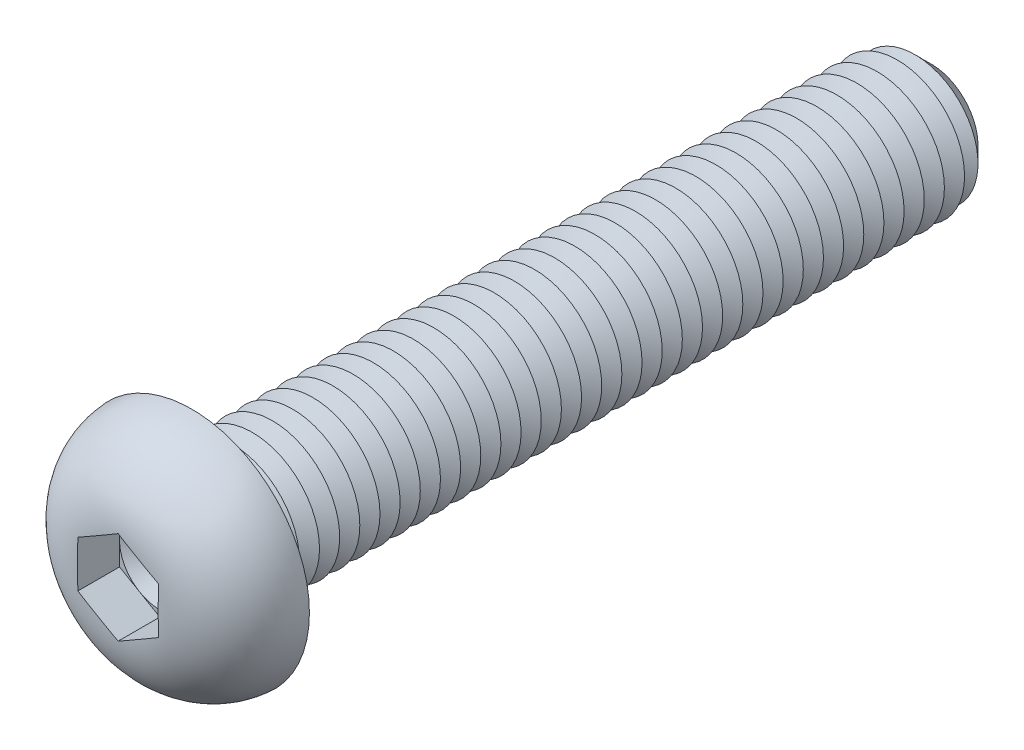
ISO-10303-21;
HEADER;
FILE_DESCRIPTION(('STEP AP214'),'2;1');
FILE_NAME('part.step','',(''),(''),'','','');
FILE_SCHEMA(('AUTOMOTIVE_DESIGN { 1 0 10303 214 1 1 1 1 }'));
ENDSEC;
DATA;
#1=APPLICATION_CONTEXT('core data for automotive mechanical design processes');
#2=APPLICATION_PROTOCOL_DEFINITION('international standard','automotive_design',2000,#1);
#3=PRODUCT_CONTEXT('',#1,'mechanical');
#4=PRODUCT('Part','Part','',(#3));
#5=PRODUCT_RELATED_PRODUCT_CATEGORY('part','',(#4));
#6=PRODUCT_DEFINITION_FORMATION('','',#4);
#7=PRODUCT_DEFINITION_CONTEXT('part definition',#1,'design');
#8=PRODUCT_DEFINITION('design','',#6,#7);
#9=PRODUCT_DEFINITION_SHAPE('','',#8);
#10=(LENGTH_UNIT() NAMED_UNIT(*) SI_UNIT(.MILLI.,.METRE.));
#11=(NAMED_UNIT(*) PLANE_ANGLE_UNIT() SI_UNIT($,.RADIAN.));
#12=(NAMED_UNIT(*) SI_UNIT($,.STERADIAN.) SOLID_ANGLE_UNIT());
#13=UNCERTAINTY_MEASURE_WITH_UNIT(LENGTH_MEASURE(1.E-05),#10,'distance_accuracy_value','');
#14=(GEOMETRIC_REPRESENTATION_CONTEXT(3) GLOBAL_UNCERTAINTY_ASSIGNED_CONTEXT((#13)) GLOBAL_UNIT_ASSIGNED_CONTEXT((#10,
#11,#12)) REPRESENTATION_CONTEXT('',''));
#15=CARTESIAN_POINT('',(0.,0.,0.));
#16=DIRECTION('',(0.,0.,1.));
#17=DIRECTION('',(1.,0.,0.));
#18=AXIS2_PLACEMENT_3D('',#15,#16,#17);
#19=CARTESIAN_POINT('',(0.,0.,2.38));
#20=DIRECTION('',(0.,0.,1.));
#21=DIRECTION('',(1.,0.,0.));
#22=AXIS2_PLACEMENT_3D('',#19,#20,#21);
#23=PLANE('',#22);
#24=CARTESIAN_POINT('',(0.,0.,2.38));
#25=DIRECTION('',(0.,0.,1.));
#26=DIRECTION('',(1.,0.,0.));
#27=AXIS2_PLACEMENT_3D('',#24,#25,#26);
#28=CIRCLE('',#27,3.);
#29=CARTESIAN_POINT('',(3.,0.,2.38));
#30=VERTEX_POINT('',#29);
#31=CARTESIAN_POINT('',(1.5,2.59807621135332,2.38));
#32=VERTEX_POINT('',#31);
#33=EDGE_CURVE('E117',#30,#32,#28,.T.);
#34=ORIENTED_EDGE('',*,*,#33,.F.);
#35=DIRECTION('',(0.,1.,0.));
#36=VECTOR('',#35,1.);
#37=CARTESIAN_POINT('',(3.,-1.73205080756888,2.38));
#38=LINE('',#37,#36);
#39=CARTESIAN_POINT('',(3.,1.73205080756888,2.38));
#40=VERTEX_POINT('',#39);
#41=EDGE_CURVE('E140',#30,#40,#38,.T.);
#42=ORIENTED_EDGE('',*,*,#41,.T.);
#43=DIRECTION('',(-0.866025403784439,0.5,0.));
#44=VECTOR('',#43,1.);
#45=CARTESIAN_POINT('',(3.,1.73205080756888,2.38));
#46=LINE('',#45,#44);
#47=EDGE_CURVE('E136',#40,#32,#46,.T.);
#48=ORIENTED_EDGE('',*,*,#47,.T.);
#49=EDGE_LOOP('',(#34,#42,#48));
#50=FACE_BOUND('',#49,.T.);
#51=ADVANCED_FACE('F39',(#50),#23,.T.);
#52=CARTESIAN_POINT('',(0.,0.,2.38));
#53=DIRECTION('',(0.,0.,1.));
#54=DIRECTION('',(1.,0.,0.));
#55=AXIS2_PLACEMENT_3D('',#52,#53,#54);
#56=CIRCLE('',#55,3.);
#57=CARTESIAN_POINT('',(-1.5,2.59807621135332,2.38));
#58=VERTEX_POINT('',#57);
#59=EDGE_CURVE('E11',#32,#58,#56,.T.);
#60=ORIENTED_EDGE('',*,*,#59,.F.);
#61=CARTESIAN_POINT('',(0.,3.46410161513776,2.38));
#62=VERTEX_POINT('',#61);
#63=EDGE_CURVE('E130',#32,#62,#46,.T.);
#64=ORIENTED_EDGE('',*,*,#63,.T.);
#65=DIRECTION('',(-0.866025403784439,-0.5,0.));
#66=VECTOR('',#65,1.);
#67=CARTESIAN_POINT('',(0.,3.46410161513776,2.38));
#68=LINE('',#67,#66);
#69=EDGE_CURVE('E131',#62,#58,#68,.T.);
#70=ORIENTED_EDGE('',*,*,#69,.T.);
#71=EDGE_LOOP('',(#60,#64,#70));
#72=FACE_BOUND('',#71,.T.);
#73=ADVANCED_FACE('F129',(#72),#23,.T.);
#74=CARTESIAN_POINT('',(-3.,0.,2.38));
#75=VERTEX_POINT('',#74);
#76=EDGE_CURVE('E49',#58,#75,#56,.T.);
#77=ORIENTED_EDGE('',*,*,#76,.F.);
#78=CARTESIAN_POINT('',(-3.,1.73205080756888,2.38));
#79=VERTEX_POINT('',#78);
#80=EDGE_CURVE('E143',#58,#79,#68,.T.);
#81=ORIENTED_EDGE('',*,*,#80,.T.);
#82=DIRECTION('',(0.,-1.,0.));
#83=VECTOR('',#82,1.);
#84=CARTESIAN_POINT('',(-3.,1.73205080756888,2.38));
#85=LINE('',#84,#83);
#86=EDGE_CURVE('E153',#79,#75,#85,.T.);
#87=ORIENTED_EDGE('',*,*,#86,.T.);
#88=EDGE_LOOP('',(#77,#81,#87));
#89=FACE_BOUND('',#88,.T.);
#90=ADVANCED_FACE('F276',(#89),#23,.T.);
#91=CARTESIAN_POINT('',(-1.5,-2.59807621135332,2.38));
#92=VERTEX_POINT('',#91);
#93=EDGE_CURVE('E260',#75,#92,#56,.T.);
#94=ORIENTED_EDGE('',*,*,#93,.F.);
#95=CARTESIAN_POINT('',(-3.,-1.73205080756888,2.38));
#96=VERTEX_POINT('',#95);
#97=EDGE_CURVE('E152',#75,#96,#85,.T.);
#98=ORIENTED_EDGE('',*,*,#97,.T.);
#99=DIRECTION('',(0.866025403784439,-0.5,0.));
#100=VECTOR('',#99,1.);
#101=CARTESIAN_POINT('',(-3.,-1.73205080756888,2.38));
#102=LINE('',#101,#100);
#103=EDGE_CURVE('E158',#96,#92,#102,.T.);
#104=ORIENTED_EDGE('',*,*,#103,.T.);
#105=EDGE_LOOP('',(#94,#98,#104));
#106=FACE_BOUND('',#105,.T.);
#107=ADVANCED_FACE('F270',(#106),#23,.T.);
#108=CARTESIAN_POINT('',(1.5,-2.59807621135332,2.38));
#109=VERTEX_POINT('',#108);
#110=EDGE_CURVE('E56',#92,#109,#56,.T.);
#111=ORIENTED_EDGE('',*,*,#110,.F.);
#112=CARTESIAN_POINT('',(0.,-3.46410161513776,2.38));
#113=VERTEX_POINT('',#112);
#114=EDGE_CURVE('E157',#92,#113,#102,.T.);
#115=ORIENTED_EDGE('',*,*,#114,.T.);
#116=DIRECTION('',(0.866025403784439,0.5,0.));
#117=VECTOR('',#116,1.);
#118=CARTESIAN_POINT('',(0.,-3.46410161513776,2.38));
#119=LINE('',#118,#117);
#120=EDGE_CURVE('E163',#113,#109,#119,.T.);
#121=ORIENTED_EDGE('',*,*,#120,.T.);
#122=EDGE_LOOP('',(#111,#115,#121));
#123=FACE_BOUND('',#122,.T.);
#124=ADVANCED_FACE('F313',(#123),#23,.T.);
#125=CARTESIAN_POINT('',(0.,0.,-55.));
#126=DIRECTION('',(0.,0.,1.));
#127=DIRECTION('',(1.,0.,0.));
#128=AXIS2_PLACEMENT_3D('',#125,#126,#127);
#129=CYLINDRICAL_SURFACE('',#128,5.);
#130=CARTESIAN_POINT('',(0.,0.,-0.600000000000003));
#131=DIRECTION('',(0.,0.,1.));
#132=DIRECTION('',(1.,0.,0.));
#133=AXIS2_PLACEMENT_3D('',#130,#131,#132);
#134=CIRCLE('',#133,5.);
#135=CARTESIAN_POINT('',(5.,0.,-0.600000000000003));
#136=VERTEX_POINT('',#135);
#137=EDGE_CURVE('E242',#136,#136,#134,.F.);
#138=ORIENTED_EDGE('',*,*,#137,.T.);
#139=EDGE_LOOP('',(#138));
#140=FACE_BOUND('',#139,.T.);
#141=CARTESIAN_POINT('',(0.,0.,-1.5));
#142=DIRECTION('',(0.,0.,1.));
#143=DIRECTION('',(1.,0.,0.));
#144=AXIS2_PLACEMENT_3D('',#141,#142,#143);
#145=CIRCLE('',#144,5.00000000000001);
#146=CARTESIAN_POINT('',(5.00000000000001,0.,-1.5));
#147=VERTEX_POINT('',#146);
#148=EDGE_CURVE('E138',#147,#147,#145,.T.);
#149=ORIENTED_EDGE('',*,*,#148,.T.);
#150=EDGE_LOOP('',(#149));
#151=FACE_BOUND('',#150,.T.);
#152=ADVANCED_FACE('F314',(#140,#151),#129,.T.);
#153=CARTESIAN_POINT('',(0.,8.75,0.));
#154=DIRECTION('',(0.,0.,1.));
#155=DIRECTION('',(1.,0.,0.));
#156=AXIS2_PLACEMENT_3D('',#153,#154,#155);
#157=PLANE('',#156);
#158=CARTESIAN_POINT('',(0.,0.,0.));
#159=DIRECTION('',(0.,0.,1.));
#160=DIRECTION('',(1.,0.,0.));
#161=AXIS2_PLACEMENT_3D('',#158,#159,#160);
#162=CIRCLE('',#161,5.6);
#163=CARTESIAN_POINT('',(5.6,0.,0.));
#164=VERTEX_POINT('',#163);
#165=EDGE_CURVE('E251',#164,#164,#162,.T.);
#166=ORIENTED_EDGE('',*,*,#165,.T.);
#167=EDGE_LOOP('',(#166));
#168=FACE_BOUND('',#167,.T.);
#169=CARTESIAN_POINT('',(0.,0.,0.));
#170=DIRECTION('',(0.,0.,1.));
#171=DIRECTION('',(1.,0.,0.));
#172=AXIS2_PLACEMENT_3D('',#169,#170,#171);
#173=CIRCLE('',#172,8.75);
#174=CARTESIAN_POINT('',(8.75,0.,0.));
#175=VERTEX_POINT('',#174);
#176=EDGE_CURVE('E174',#175,#175,#173,.T.);
#177=ORIENTED_EDGE('',*,*,#176,.F.);
#178=EDGE_LOOP('',(#177));
#179=FACE_BOUND('',#178,.T.);
#180=ADVANCED_FACE('F317',(#168,#179),#157,.F.);
#181=CARTESIAN_POINT('',(0.,0.,-0.3));
#182=DIRECTION('',(0.,0.,1.));
#183=DIRECTION('',(1.,0.,0.));
#184=AXIS2_PLACEMENT_3D('',#181,#182,#183);
#185=DEGENERATE_TOROIDAL_SURFACE('',#184,2.95776381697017,5.8,.T.);
#186=CARTESIAN_POINT('',(-3.0002,1.73193533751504,5.47784605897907));
#187=CARTESIAN_POINT('',(-2.87524340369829,1.80407906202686,5.4841525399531));
#188=CARTESIAN_POINT('',(-2.75023731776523,1.87625135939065,5.48853670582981));
#189=CARTESIAN_POINT('',(-2.5001955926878,2.02061301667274,5.49472046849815));
#190=CARTESIAN_POINT('',(-2.37515996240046,2.09280237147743,5.49652051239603));
#191=CARTESIAN_POINT('',(-2.12510741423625,2.23717027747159,5.4987972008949));
#192=CARTESIAN_POINT('',(-2.00009049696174,2.30934882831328,5.49927407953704));
#193=CARTESIAN_POINT('',(-1.75004905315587,2.45371032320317,5.49979859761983));
#194=CARTESIAN_POINT('',(-1.62502452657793,2.52589326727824,5.49984621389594));
#195=CARTESIAN_POINT('',(-1.37497547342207,2.67025915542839,5.49984621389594));
#196=CARTESIAN_POINT('',(-1.24995094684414,2.74244209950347,5.49979859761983));
#197=CARTESIAN_POINT('',(-0.999909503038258,2.88680359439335,5.49927407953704));
#198=CARTESIAN_POINT('',(-0.874892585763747,2.95898214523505,5.4987972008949));
#199=CARTESIAN_POINT('',(-0.624840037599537,3.10335005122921,5.49652051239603));
#200=CARTESIAN_POINT('',(-0.499804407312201,3.1755394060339,5.49472046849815));
#201=CARTESIAN_POINT('',(-0.249762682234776,3.31990106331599,5.48853670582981));
#202=CARTESIAN_POINT('',(-0.124756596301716,3.39207336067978,5.4841525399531));
#203=CARTESIAN_POINT('',(0.000199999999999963,3.46421708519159,5.47784605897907));
#204=B_SPLINE_CURVE_WITH_KNOTS('',3,(#186,#187,#188,#189,#190,#191,#192,#193,#194,#195,#196,
#197,#198,#199,#200,#201,#202,#203),.UNSPECIFIED.,.F.,.F.,(4,2,2,2,2,2,2,2,4),(0.,
0.433225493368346,0.866376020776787,1.29944992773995,1.73254720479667,2.16564448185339,
2.59871838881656,3.031868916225,3.46509440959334),.UNSPECIFIED.);
#205=CARTESIAN_POINT('',(-3.,1.73205080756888,5.4778561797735));
#206=VERTEX_POINT('',#205);
#207=CARTESIAN_POINT('',(0.,3.46410161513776,5.4778561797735));
#208=VERTEX_POINT('',#207);
#209=EDGE_CURVE('E196',#206,#208,#204,.T.);
#210=ORIENTED_EDGE('',*,*,#209,.T.);
#211=CARTESIAN_POINT('',(-0.000200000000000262,3.46421708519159,5.47784605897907));
#212=CARTESIAN_POINT('',(0.124756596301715,3.39207336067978,5.4841525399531));
#213=CARTESIAN_POINT('',(0.249762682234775,3.31990106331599,5.48853670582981));
#214=CARTESIAN_POINT('',(0.4998044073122,3.1755394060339,5.49472046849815));
#215=CARTESIAN_POINT('',(0.624840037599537,3.10335005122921,5.49652051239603));
#216=CARTESIAN_POINT('',(0.874892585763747,2.95898214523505,5.4987972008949));
#217=CARTESIAN_POINT('',(0.999909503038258,2.88680359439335,5.49927407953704));
#218=CARTESIAN_POINT('',(1.24995094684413,2.74244209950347,5.49979859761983));
#219=CARTESIAN_POINT('',(1.37497547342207,2.67025915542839,5.49984621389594));
#220=CARTESIAN_POINT('',(1.62502452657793,2.52589326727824,5.49984621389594));
#221=CARTESIAN_POINT('',(1.75004905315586,2.45371032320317,5.49979859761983));
#222=CARTESIAN_POINT('',(2.00009049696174,2.30934882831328,5.49927407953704));
#223=CARTESIAN_POINT('',(2.12510741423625,2.23717027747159,5.4987972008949));
#224=CARTESIAN_POINT('',(2.37515996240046,2.09280237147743,5.49652051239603));
#225=CARTESIAN_POINT('',(2.5001955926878,2.02061301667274,5.49472046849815));
#226=CARTESIAN_POINT('',(2.75023731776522,1.87625135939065,5.48853670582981));
#227=CARTESIAN_POINT('',(2.87524340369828,1.80407906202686,5.4841525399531));
#228=CARTESIAN_POINT('',(3.0002,1.73193533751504,5.47784605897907));
#229=B_SPLINE_CURVE_WITH_KNOTS('',3,(#211,#212,#213,#214,#215,#216,#217,#218,#219,#220,#221,
#222,#223,#224,#225,#226,#227,#228),.UNSPECIFIED.,.F.,.F.,(4,2,2,2,2,2,2,2,4),(0.,
0.433225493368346,0.866376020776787,1.29944992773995,1.73254720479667,2.16564448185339,
2.59871838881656,3.031868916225,3.46509440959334),.UNSPECIFIED.);
#230=CARTESIAN_POINT('',(3.,1.73205080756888,5.47785617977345));
#231=VERTEX_POINT('',#230);
#232=EDGE_CURVE('E225',#208,#231,#229,.T.);
#233=ORIENTED_EDGE('',*,*,#232,.T.);
#234=CARTESIAN_POINT('',(3.,0.,5.49984621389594));
#235=CARTESIAN_POINT('',(3.,-0.125570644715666,5.49984449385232));
#236=CARTESIAN_POINT('',(3.,-0.251141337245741,5.49980426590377));
#237=CARTESIAN_POINT('',(3.,-0.502283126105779,5.499449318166));
#238=CARTESIAN_POINT('',(3.,-0.62785422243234,5.49913459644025));
#239=CARTESIAN_POINT('',(3.,-0.879037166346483,5.49770394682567));
#240=CARTESIAN_POINT('',(3.,-1.00464901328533,5.49658774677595));
#241=CARTESIAN_POINT('',(3.,-1.2558477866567,5.49279605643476));
#242=CARTESIAN_POINT('',(3.,-1.38143471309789,5.49012056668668));
#243=CARTESIAN_POINT('',(3.,-1.7568847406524,5.47847778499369));
#244=CARTESIAN_POINT('',(3.,-2.00667103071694,5.46590367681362));
#245=CARTESIAN_POINT('',(3.,-2.50488375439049,5.42441448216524));
#246=CARTESIAN_POINT('',(3.,-2.75331093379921,5.3955095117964));
#247=CARTESIAN_POINT('',(3.,-3.18719021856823,5.32582626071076));
#248=CARTESIAN_POINT('',(3.,-3.3733635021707,5.28960049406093));
#249=CARTESIAN_POINT('',(3.,-3.74245496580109,5.20330651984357));
#250=CARTESIAN_POINT('',(3.,-3.92537417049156,5.15324275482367));
#251=CARTESIAN_POINT('',(3.,-4.28675502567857,5.03819885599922));
#252=CARTESIAN_POINT('',(3.,-4.46521058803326,4.97319946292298));
#253=CARTESIAN_POINT('',(3.,-4.81576789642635,4.82782766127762));
#254=CARTESIAN_POINT('',(3.,-4.98786985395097,4.74745576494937));
#255=CARTESIAN_POINT('',(3.,-5.3254008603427,4.5705398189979));
#256=CARTESIAN_POINT('',(3.,-5.49076268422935,4.47386710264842));
#257=CARTESIAN_POINT('',(3.,-5.81151175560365,4.26514040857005));
#258=CARTESIAN_POINT('',(3.,-5.96689840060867,4.15308550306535));
#259=CARTESIAN_POINT('',(3.,-6.26591787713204,3.91428862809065));
#260=CARTESIAN_POINT('',(3.,-6.40955257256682,3.78754899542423));
#261=CARTESIAN_POINT('',(3.,-6.68342295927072,3.52034797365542));
#262=CARTESIAN_POINT('',(3.,-6.81366070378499,3.3798886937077));
#263=CARTESIAN_POINT('',(3.,-7.0426666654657,3.10626157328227));
#264=CARTESIAN_POINT('',(3.,-7.1433109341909,2.97465879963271));
#265=CARTESIAN_POINT('',(3.,-7.33253056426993,2.70304716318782));
#266=CARTESIAN_POINT('',(3.,-7.42110686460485,2.56303895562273));
#267=CARTESIAN_POINT('',(3.,-7.58534868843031,2.27573732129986));
#268=CARTESIAN_POINT('',(3.,-7.66102067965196,2.12844759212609));
#269=CARTESIAN_POINT('',(3.,-7.79881901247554,1.82765987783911));
#270=CARTESIAN_POINT('',(3.,-7.86094563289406,1.67416202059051));
#271=CARTESIAN_POINT('',(3.,-7.96803488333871,1.37082076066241));
#272=CARTESIAN_POINT('',(3.,-8.01375687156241,1.22124490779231));
#273=CARTESIAN_POINT('',(3.,-8.09224398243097,0.918674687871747));
#274=CARTESIAN_POINT('',(3.,-8.12500479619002,0.765679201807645));
#275=CARTESIAN_POINT('',(3.,-8.17726457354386,0.457507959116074));
#276=CARTESIAN_POINT('',(3.,-8.1967692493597,0.302333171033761));
#277=CARTESIAN_POINT('',(3.,-8.22238322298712,-0.00917738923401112));
#278=CARTESIAN_POINT('',(3.,-8.22848754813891,-0.165513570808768));
#279=CARTESIAN_POINT('',(3.,-8.22724693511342,-0.475358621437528));
#280=CARTESIAN_POINT('',(3.,-8.2201384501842,-0.628868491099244));
#281=CARTESIAN_POINT('',(3.,-8.1929851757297,-0.934809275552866));
#282=CARTESIAN_POINT('',(3.,-8.17293462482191,-1.0872396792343));
#283=CARTESIAN_POINT('',(3.,-8.1200547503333,-1.38984943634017));
#284=CARTESIAN_POINT('',(3.,-8.08722683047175,-1.54002903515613));
#285=CARTESIAN_POINT('',(3.,-8.0090712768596,-1.83702738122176));
#286=CARTESIAN_POINT('',(3.,-7.96374919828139,-1.98384759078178));
#287=CARTESIAN_POINT('',(3.,-7.86096457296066,-2.27315566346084));
#288=CARTESIAN_POINT('',(3.,-7.80350334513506,-2.41564399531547));
#289=CARTESIAN_POINT('',(3.,-7.67691451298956,-2.6952770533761));
#290=CARTESIAN_POINT('',(3.,-7.60779108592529,-2.83242367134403));
#291=CARTESIAN_POINT('',(3.,-7.45837210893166,-3.10056990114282));
#292=CARTESIAN_POINT('',(3.,-7.37807144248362,-3.23156666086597));
#293=CARTESIAN_POINT('',(3.,-7.20697634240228,-3.48645411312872));
#294=CARTESIAN_POINT('',(3.,-7.11618520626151,-3.61034702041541));
#295=CARTESIAN_POINT('',(3.,-6.92334779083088,-3.85210954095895));
#296=CARTESIAN_POINT('',(3.,-6.82115263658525,-3.96986038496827));
#297=CARTESIAN_POINT('',(3.,-6.60745266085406,-4.19658717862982));
#298=CARTESIAN_POINT('',(3.,-6.49594754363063,-4.30556284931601));
#299=CARTESIAN_POINT('',(3.,-6.26450055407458,-4.51413072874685));
#300=CARTESIAN_POINT('',(3.,-6.14455919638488,-4.61372350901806));
#301=CARTESIAN_POINT('',(3.,-5.8971402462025,-4.80306090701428));
#302=CARTESIAN_POINT('',(3.,-5.76966228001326,-4.89280503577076));
#303=CARTESIAN_POINT('',(3.,-5.50268934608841,-5.06561354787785));
#304=CARTESIAN_POINT('',(3.,-5.36291526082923,-5.14824654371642));
#305=CARTESIAN_POINT('',(3.,-5.07726499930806,-5.30226841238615));
#306=CARTESIAN_POINT('',(3.,-4.93138704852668,-5.37365398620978));
#307=CARTESIAN_POINT('',(3.,-4.63484455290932,-5.50505544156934));
#308=CARTESIAN_POINT('',(3.,-4.48418671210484,-5.56508649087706));
#309=CARTESIAN_POINT('',(3.,-4.17906596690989,-5.6740700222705));
#310=CARTESIAN_POINT('',(3.,-4.02460600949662,-5.72303080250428));
#311=CARTESIAN_POINT('',(3.,-3.6739247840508,-5.82125760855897));
#312=CARTESIAN_POINT('',(3.,-3.47687521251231,-5.86756841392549));
#313=CARTESIAN_POINT('',(3.,-3.07981530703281,-5.94521593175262));
#314=CARTESIAN_POINT('',(3.,-2.87980357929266,-5.97654534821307));
#315=CARTESIAN_POINT('',(3.,-2.47751859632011,-6.02656554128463));
#316=CARTESIAN_POINT('',(3.,-2.27523974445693,-6.0452096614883));
#317=CARTESIAN_POINT('',(3.,-1.8700786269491,-6.07274849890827));
#318=CARTESIAN_POINT('',(3.,-1.66719636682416,-6.08164330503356));
#319=CARTESIAN_POINT('',(3.,-1.25887867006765,-6.09343726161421));
#320=CARTESIAN_POINT('',(3.,-1.05344157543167,-6.09626381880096));
#321=CARTESIAN_POINT('',(3.,-0.745285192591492,-6.0985660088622));
#322=CARTESIAN_POINT('',(3.,-0.642567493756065,-6.09901047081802));
#323=CARTESIAN_POINT('',(3.,-0.437131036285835,-6.09957976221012));
#324=CARTESIAN_POINT('',(3.,-0.334412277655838,-6.09970459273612));
#325=CARTESIAN_POINT('',(3.,-0.129132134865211,-6.09984385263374));
#326=CARTESIAN_POINT('',(3.,-0.0265707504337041,-6.09985845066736));
#327=CARTESIAN_POINT('',(3.,0.178552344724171,-6.09981980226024));
#328=CARTESIAN_POINT('',(3.,0.281114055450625,-6.09976655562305));
#329=CARTESIAN_POINT('',(3.,0.486235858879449,-6.09946703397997));
#330=CARTESIAN_POINT('',(3.,0.588795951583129,-6.0992207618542));
#331=CARTESIAN_POINT('',(3.,0.793913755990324,-6.09826017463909));
#332=CARTESIAN_POINT('',(3.,0.896471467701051,-6.097545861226));
#333=CARTESIAN_POINT('',(3.,1.11088851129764,-6.0951586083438));
#334=CARTESIAN_POINT('',(3.,1.22274716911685,-6.0934045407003));
#335=CARTESIAN_POINT('',(3.,1.44642575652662,-6.08829151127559));
#336=CARTESIAN_POINT('',(3.,1.55824568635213,-6.08493255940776));
#337=CARTESIAN_POINT('',(3.,1.89360474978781,-6.07150074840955));
#338=CARTESIAN_POINT('',(3.,2.11703989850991,-6.05807293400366));
#339=CARTESIAN_POINT('',(3.,2.56083256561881,-6.01778675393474));
#340=CARTESIAN_POINT('',(3.,2.78120000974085,-5.99104517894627));
#341=CARTESIAN_POINT('',(3.,3.2192866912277,-5.92065658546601));
#342=CARTESIAN_POINT('',(3.,3.43700630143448,-5.8770119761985));
#343=CARTESIAN_POINT('',(3.,3.82666678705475,-5.78060449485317));
#344=CARTESIAN_POINT('',(3.,3.99942726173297,-5.73116262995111));
#345=CARTESIAN_POINT('',(3.,4.3405567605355,-5.61888897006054));
#346=CARTESIAN_POINT('',(3.,4.50892617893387,-5.55605838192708));
#347=CARTESIAN_POINT('',(3.,4.84049143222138,-5.41635874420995));
#348=CARTESIAN_POINT('',(3.,5.00366586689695,-5.33943871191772));
#349=CARTESIAN_POINT('',(3.,5.32271829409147,-5.17167128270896));
#350=CARTESIAN_POINT('',(3.,5.47859600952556,-5.0808233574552));
#351=CARTESIAN_POINT('',(3.,5.7822829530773,-4.88500135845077));
#352=CARTESIAN_POINT('',(3.,5.93005015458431,-4.77996197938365));
#353=CARTESIAN_POINT('',(3.,6.21523046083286,-4.55663689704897));
#354=CARTESIAN_POINT('',(3.,6.35264336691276,-4.43835093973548));
#355=CARTESIAN_POINT('',(3.,6.61552762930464,-4.18948618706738));
#356=CARTESIAN_POINT('',(3.,6.74101380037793,-4.05892305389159));
#357=CARTESIAN_POINT('',(3.,6.97891308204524,-3.78639059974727));
#358=CARTESIAN_POINT('',(3.,7.09132750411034,-3.64442242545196));
#359=CARTESIAN_POINT('',(3.,7.29113623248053,-3.36530209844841));
#360=CARTESIAN_POINT('',(3.,7.37991316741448,-3.22913733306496));
#361=CARTESIAN_POINT('',(3.,7.5451968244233,-2.94955428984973));
#362=CARTESIAN_POINT('',(3.,7.62170419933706,-2.80613639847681));
#363=CARTESIAN_POINT('',(3.,7.76177641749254,-2.5131168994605));
#364=CARTESIAN_POINT('',(3.,7.82534152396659,-2.36351541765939));
#365=CARTESIAN_POINT('',(3.,7.93897019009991,-2.05926799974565));
#366=CARTESIAN_POINT('',(3.,7.98903395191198,-1.9046221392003));
#367=CARTESIAN_POINT('',(3.,8.07336540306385,-1.59821781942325));
#368=CARTESIAN_POINT('',(3.,8.10821878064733,-1.44662026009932));
#369=CARTESIAN_POINT('',(3.,8.16487862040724,-1.14095089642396));
#370=CARTESIAN_POINT('',(3.,8.18668070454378,-0.986878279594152));
#371=CARTESIAN_POINT('',(3.,8.21703234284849,-0.677515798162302));
#372=CARTESIAN_POINT('',(3.,8.22558889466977,-0.522226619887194));
#373=CARTESIAN_POINT('',(3.,8.22940229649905,-0.211427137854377));
#374=CARTESIAN_POINT('',(3.,8.22465425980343,-0.0559167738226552));
#375=CARTESIAN_POINT('',(3.,8.20204101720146,0.252033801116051));
#376=CARTESIAN_POINT('',(3.,8.18435378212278,0.404487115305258));
#377=CARTESIAN_POINT('',(3.,8.136196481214,0.707418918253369));
#378=CARTESIAN_POINT('',(3.,8.1057217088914,0.857896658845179));
#379=CARTESIAN_POINT('',(3.,8.03224632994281,1.15569567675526));
#380=CARTESIAN_POINT('',(3.,7.9892508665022,1.30301822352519));
#381=CARTESIAN_POINT('',(3.,7.89104818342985,1.59360769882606));
#382=CARTESIAN_POINT('',(3.,7.83583549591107,1.73687277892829));
#383=CARTESIAN_POINT('',(3.,7.71349498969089,2.01864020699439));
#384=CARTESIAN_POINT('',(3.,7.64633814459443,2.1571299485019));
#385=CARTESIAN_POINT('',(3.,7.50076383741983,2.42797950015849));
#386=CARTESIAN_POINT('',(3.,7.42235122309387,2.56034191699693));
#387=CARTESIAN_POINT('',(3.,7.25483284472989,2.8181715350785));
#388=CARTESIAN_POINT('',(3.,7.16572386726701,2.94363664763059));
#389=CARTESIAN_POINT('',(3.,6.9775559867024,3.1867979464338));
#390=CARTESIAN_POINT('',(3.,6.87850037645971,3.30449668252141));
#391=CARTESIAN_POINT('',(3.,6.66919743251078,3.53363644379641));
#392=CARTESIAN_POINT('',(3.,6.55877281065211,3.6449154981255));
#393=CARTESIAN_POINT('',(3.,6.32925753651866,3.85806320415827));
#394=CARTESIAN_POINT('',(3.,6.21016952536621,3.95993470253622));
#395=CARTESIAN_POINT('',(3.,5.96413069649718,4.15386505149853));
#396=CARTESIAN_POINT('',(3.,5.83717459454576,4.24591719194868));
#397=CARTESIAN_POINT('',(3.,5.5764653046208,4.41973423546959));
#398=CARTESIAN_POINT('',(3.,5.4427139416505,4.50150188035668));
#399=CARTESIAN_POINT('',(3.,5.16249709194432,4.65840017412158));
#400=CARTESIAN_POINT('',(3.,5.01573037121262,4.73299250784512));
#401=CARTESIAN_POINT('',(3.,4.71685583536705,4.87057528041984));
#402=CARTESIAN_POINT('',(3.,4.56474751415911,4.93356461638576));
#403=CARTESIAN_POINT('',(3.,4.25657035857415,5.04801407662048));
#404=CARTESIAN_POINT('',(3.,4.10050882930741,5.09949395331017));
#405=CARTESIAN_POINT('',(3.,3.78523286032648,5.19149003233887));
#406=CARTESIAN_POINT('',(3.,3.62601895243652,5.23200806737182));
#407=CARTESIAN_POINT('',(3.,3.32461902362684,5.29856444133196));
#408=CARTESIAN_POINT('',(3.,3.18268434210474,5.32575733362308));
#409=CARTESIAN_POINT('',(3.,2.89760844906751,5.3729307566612));
#410=CARTESIAN_POINT('',(3.,2.75446703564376,5.39291005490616));
#411=CARTESIAN_POINT('',(3.,2.46730946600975,5.42656527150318));
#412=CARTESIAN_POINT('',(3.,2.32329255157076,5.44023457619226));
#413=CARTESIAN_POINT('',(3.,2.03487642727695,5.46234228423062));
#414=CARTESIAN_POINT('',(3.,1.89047722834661,5.4707808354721));
#415=CARTESIAN_POINT('',(3.,1.60058090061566,5.48373897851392));
#416=CARTESIAN_POINT('',(3.,1.45508270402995,5.48823290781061));
#417=CARTESIAN_POINT('',(3.,1.16402671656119,5.49458098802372));
#418=CARTESIAN_POINT('',(3.,1.01846892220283,5.49643495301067));
#419=CARTESIAN_POINT('',(3.,0.72742451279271,5.49877506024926));
#420=CARTESIAN_POINT('',(3.,0.581937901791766,5.49926194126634));
#421=CARTESIAN_POINT('',(3.,0.290967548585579,5.49979850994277));
#422=CARTESIAN_POINT('',(3.,0.145483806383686,5.49984820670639));
#423=CARTESIAN_POINT('',(3.,0.,5.49984621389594));
#424=B_SPLINE_CURVE_WITH_KNOTS('',3,(#234,#235,#236,#237,#238,#239,#240,#241,#242,#243,#244,
#245,#246,#247,#248,#249,#250,#251,#252,#253,#254,#255,#256,#257,#258,#259,#260,#261,#262,#263,
#264,#265,#266,#267,#268,#269,#270,#271,#272,#273,#274,#275,#276,#277,#278,#279,#280,#281,#282,
#283,#284,#285,#286,#287,#288,#289,#290,#291,#292,#293,#294,#295,#296,#297,#298,#299,#300,#301,
#302,#303,#304,#305,#306,#307,#308,#309,#310,#311,#312,#313,#314,#315,#316,#317,#318,#319,#320,
#321,#322,#323,#324,#325,#326,#327,#328,#329,#330,#331,#332,#333,#334,#335,#336,#337,#338,#339,
#340,#341,#342,#343,#344,#345,#346,#347,#348,#349,#350,#351,#352,#353,#354,#355,#356,#357,#358,
#359,#360,#361,#362,#363,#364,#365,#366,#367,#368,#369,#370,#371,#372,#373,#374,#375,#376,#377,
#378,#379,#380,#381,#382,#383,#384,#385,#386,#387,#388,#389,#390,#391,#392,#393,#394,#395,#396,
#397,#398,#399,#400,#401,#402,#403,#404,#405,#406,#407,#408,#409,#410,#411,#412,#413,#414,#415,
#416,#417,#418,#419,#420,#421,#422,#423),.UNSPECIFIED.,.T.,.F.,(4,2,2,2,2,2,2,2,2,2,2,2,2,2,2,2,
2,2,2,2,2,2,2,2,2,2,2,2,2,2,2,2,2,2,2,2,2,2,2,2,2,2,2,2,2,2,2,2,2,2,2,2,2,2,2,2,2,2,2,2,2,2,2,2,
2,2,2,2,2,2,2,2,2,2,2,2,2,2,2,2,2,2,2,2,2,2,2,2,2,2,2,2,2,2,4),(0.,0.376711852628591,
0.753426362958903,1.13026885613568,1.50711121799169,2.257095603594,3.00661592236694,
3.57514719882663,4.14349616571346,4.71258216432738,5.28164920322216,5.85543852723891,
6.42926247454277,7.00299523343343,7.57663992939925,8.07303876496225,8.56939895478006,
9.06550962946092,9.56161009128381,10.030267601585,10.4990807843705,10.9676918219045,
11.4364767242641,11.8969530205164,12.3576344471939,12.8182652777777,13.2786916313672,
13.7390679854,14.1992797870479,14.6597029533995,15.1199817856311,15.5871904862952,
16.0544140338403,16.5216091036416,16.9888273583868,17.4754224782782,17.9621600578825,
18.4482427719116,18.9339599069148,19.5405320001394,20.1473991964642,20.7564865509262,
21.3655683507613,21.9818967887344,22.2900536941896,22.5982095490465,22.905893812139,
23.2135789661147,23.5212595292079,23.8289389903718,24.1645461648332,24.5001512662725,
25.171371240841,25.8368042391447,26.5021424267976,27.0407309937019,27.5792710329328,
28.119799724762,28.660348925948,29.2034761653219,29.7466138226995,30.2890677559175,
30.831467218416,31.3185063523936,31.8055195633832,32.2925228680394,32.779518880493,
33.2456153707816,33.7118681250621,34.1778744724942,34.6440520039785,35.103935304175,
35.563988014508,36.0238520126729,36.4839222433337,36.9451261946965,37.4061321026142,
37.8672768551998,38.3282694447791,38.7980460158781,39.2676799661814,39.7376328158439,
40.207460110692,40.7008436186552,41.1942739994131,41.6868509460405,42.1793454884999,
42.6126940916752,43.0461167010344,43.479992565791,43.9138561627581,44.3505218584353,
44.7872183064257,45.2236787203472,45.6601300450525),.UNSPECIFIED.);
#425=CARTESIAN_POINT('',(3.,-1.73205080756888,5.4778561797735));
#426=VERTEX_POINT('',#425);
#427=EDGE_CURVE('E234',#231,#426,#424,.T.);
#428=ORIENTED_EDGE('',*,*,#427,.T.);
#429=CARTESIAN_POINT('',(3.0002,-1.73193533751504,5.47784605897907));
#430=CARTESIAN_POINT('',(2.87524340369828,-1.80407906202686,5.4841525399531));
#431=CARTESIAN_POINT('',(2.75023731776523,-1.87625135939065,5.48853670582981));
#432=CARTESIAN_POINT('',(2.5001955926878,-2.02061301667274,5.49472046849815));
#433=CARTESIAN_POINT('',(2.37515996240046,-2.09280237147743,5.49652051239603));
#434=CARTESIAN_POINT('',(2.12510741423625,-2.23717027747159,5.4987972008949));
#435=CARTESIAN_POINT('',(2.00009049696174,-2.30934882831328,5.49927407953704));
#436=CARTESIAN_POINT('',(1.75004905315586,-2.45371032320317,5.49979859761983));
#437=CARTESIAN_POINT('',(1.62502452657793,-2.52589326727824,5.49984621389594));
#438=CARTESIAN_POINT('',(1.37497547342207,-2.67025915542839,5.49984621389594));
#439=CARTESIAN_POINT('',(1.24995094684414,-2.74244209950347,5.49979859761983));
#440=CARTESIAN_POINT('',(0.999909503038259,-2.88680359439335,5.49927407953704));
#441=CARTESIAN_POINT('',(0.874892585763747,-2.95898214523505,5.4987972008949));
#442=CARTESIAN_POINT('',(0.624840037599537,-3.10335005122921,5.49652051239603));
#443=CARTESIAN_POINT('',(0.499804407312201,-3.1755394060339,5.49472046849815));
#444=CARTESIAN_POINT('',(0.249762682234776,-3.31990106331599,5.48853670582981));
#445=CARTESIAN_POINT('',(0.124756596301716,-3.39207336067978,5.4841525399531));
#446=CARTESIAN_POINT('',(-0.000199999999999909,-3.46421708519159,5.47784605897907));
#447=B_SPLINE_CURVE_WITH_KNOTS('',3,(#429,#430,#431,#432,#433,#434,#435,#436,#437,#438,#439,
#440,#441,#442,#443,#444,#445,#446),.UNSPECIFIED.,.F.,.F.,(4,2,2,2,2,2,2,2,4),(0.,
0.433225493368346,0.866376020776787,1.29944992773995,1.73254720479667,2.16564448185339,
2.59871838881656,3.031868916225,3.46509440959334),.UNSPECIFIED.);
#448=CARTESIAN_POINT('',(0.,-3.46410161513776,5.4778561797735));
#449=VERTEX_POINT('',#448);
#450=EDGE_CURVE('E287',#426,#449,#447,.T.);
#451=ORIENTED_EDGE('',*,*,#450,.T.);
#452=CARTESIAN_POINT('',(0.000200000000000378,-3.46421708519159,5.47784605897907));
#453=CARTESIAN_POINT('',(-0.124756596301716,-3.39207336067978,5.4841525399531));
#454=CARTESIAN_POINT('',(-0.249762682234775,-3.31990106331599,5.48853670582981));
#455=CARTESIAN_POINT('',(-0.499804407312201,-3.1755394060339,5.49472046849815));
#456=CARTESIAN_POINT('',(-0.624840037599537,-3.10335005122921,5.49652051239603));
#457=CARTESIAN_POINT('',(-0.874892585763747,-2.95898214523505,5.4987972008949));
#458=CARTESIAN_POINT('',(-0.999909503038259,-2.88680359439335,5.49927407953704));
#459=CARTESIAN_POINT('',(-1.24995094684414,-2.74244209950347,5.49979859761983));
#460=CARTESIAN_POINT('',(-1.37497547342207,-2.67025915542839,5.49984621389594));
#461=CARTESIAN_POINT('',(-1.62502452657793,-2.52589326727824,5.49984621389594));
#462=CARTESIAN_POINT('',(-1.75004905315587,-2.45371032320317,5.49979859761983));
#463=CARTESIAN_POINT('',(-2.00009049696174,-2.30934882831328,5.49927407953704));
#464=CARTESIAN_POINT('',(-2.12510741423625,-2.23717027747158,5.4987972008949));
#465=CARTESIAN_POINT('',(-2.37515996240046,-2.09280237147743,5.49652051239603));
#466=CARTESIAN_POINT('',(-2.5001955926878,-2.02061301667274,5.49472046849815));
#467=CARTESIAN_POINT('',(-2.75023731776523,-1.87625135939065,5.48853670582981));
#468=CARTESIAN_POINT('',(-2.87524340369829,-1.80407906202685,5.4841525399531));
#469=CARTESIAN_POINT('',(-3.0002,-1.73193533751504,5.47784605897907));
#470=B_SPLINE_CURVE_WITH_KNOTS('',3,(#452,#453,#454,#455,#456,#457,#458,#459,#460,#461,#462,
#463,#464,#465,#466,#467,#468,#469),.UNSPECIFIED.,.F.,.F.,(4,2,2,2,2,2,2,2,4),(0.,
0.433225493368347,0.866376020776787,1.29944992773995,1.73254720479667,2.16564448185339,
2.59871838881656,3.031868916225,3.46509440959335),.UNSPECIFIED.);
#471=CARTESIAN_POINT('',(-3.,-1.73205080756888,5.47785617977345));
#472=VERTEX_POINT('',#471);
#473=EDGE_CURVE('E283',#449,#472,#470,.T.);
#474=ORIENTED_EDGE('',*,*,#473,.T.);
#475=CARTESIAN_POINT('',(-3.,0.,5.49984621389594));
#476=CARTESIAN_POINT('',(-3.,0.125570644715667,5.49984449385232));
#477=CARTESIAN_POINT('',(-3.,0.251141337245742,5.49980426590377));
#478=CARTESIAN_POINT('',(-3.,0.50228312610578,5.499449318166));
#479=CARTESIAN_POINT('',(-3.,0.627854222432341,5.49913459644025));
#480=CARTESIAN_POINT('',(-3.,0.879037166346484,5.49770394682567));
#481=CARTESIAN_POINT('',(-3.,1.00464901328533,5.49658774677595));
#482=CARTESIAN_POINT('',(-3.,1.2558477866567,5.49279605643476));
#483=CARTESIAN_POINT('',(-3.,1.3814347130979,5.49012056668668));
#484=CARTESIAN_POINT('',(-3.,1.7568847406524,5.47847778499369));
#485=CARTESIAN_POINT('',(-3.,2.00667103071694,5.46590367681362));
#486=CARTESIAN_POINT('',(-3.,2.50488375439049,5.42441448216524));
#487=CARTESIAN_POINT('',(-3.,2.75331093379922,5.3955095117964));
#488=CARTESIAN_POINT('',(-3.,3.18719021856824,5.32582626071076));
#489=CARTESIAN_POINT('',(-3.,3.3733635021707,5.28960049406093));
#490=CARTESIAN_POINT('',(-3.,3.74245496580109,5.20330651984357));
#491=CARTESIAN_POINT('',(-3.,3.92537417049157,5.15324275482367));
#492=CARTESIAN_POINT('',(-3.,4.28675502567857,5.03819885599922));
#493=CARTESIAN_POINT('',(-3.,4.46521058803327,4.97319946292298));
#494=CARTESIAN_POINT('',(-3.,4.81576789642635,4.82782766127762));
#495=CARTESIAN_POINT('',(-3.,4.98786985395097,4.74745576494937));
#496=CARTESIAN_POINT('',(-3.,5.3254008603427,4.5705398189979));
#497=CARTESIAN_POINT('',(-3.,5.49076268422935,4.47386710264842));
#498=CARTESIAN_POINT('',(-3.,5.81151175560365,4.26514040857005));
#499=CARTESIAN_POINT('',(-3.,5.96689840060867,4.15308550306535));
#500=CARTESIAN_POINT('',(-3.,6.26591787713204,3.91428862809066));
#501=CARTESIAN_POINT('',(-3.,6.40955257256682,3.78754899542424));
#502=CARTESIAN_POINT('',(-3.,6.68342295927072,3.52034797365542));
#503=CARTESIAN_POINT('',(-3.,6.81366070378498,3.3798886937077));
#504=CARTESIAN_POINT('',(-3.,7.0426666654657,3.10626157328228));
#505=CARTESIAN_POINT('',(-3.,7.14331093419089,2.97465879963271));
#506=CARTESIAN_POINT('',(-3.,7.33253056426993,2.70304716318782));
#507=CARTESIAN_POINT('',(-3.,7.42110686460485,2.56303895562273));
#508=CARTESIAN_POINT('',(-3.,7.58534868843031,2.27573732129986));
#509=CARTESIAN_POINT('',(-3.,7.66102067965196,2.12844759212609));
#510=CARTESIAN_POINT('',(-3.,7.79881901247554,1.82765987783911));
#511=CARTESIAN_POINT('',(-3.,7.86094563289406,1.67416202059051));
#512=CARTESIAN_POINT('',(-3.,7.96803488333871,1.37082076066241));
#513=CARTESIAN_POINT('',(-3.,8.01375687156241,1.22124490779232));
#514=CARTESIAN_POINT('',(-3.,8.09224398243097,0.918674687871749));
#515=CARTESIAN_POINT('',(-3.,8.12500479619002,0.765679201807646));
#516=CARTESIAN_POINT('',(-3.,8.17726457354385,0.457507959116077));
#517=CARTESIAN_POINT('',(-3.,8.1967692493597,0.302333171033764));
#518=CARTESIAN_POINT('',(-3.,8.22238322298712,-0.00917738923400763));
#519=CARTESIAN_POINT('',(-3.,8.22848754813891,-0.165513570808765));
#520=CARTESIAN_POINT('',(-3.,8.22724693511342,-0.475358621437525));
#521=CARTESIAN_POINT('',(-3.,8.2201384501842,-0.628868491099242));
#522=CARTESIAN_POINT('',(-3.,8.1929851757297,-0.934809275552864));
#523=CARTESIAN_POINT('',(-3.,8.17293462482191,-1.08723967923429));
#524=CARTESIAN_POINT('',(-3.,8.1200547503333,-1.38984943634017));
#525=CARTESIAN_POINT('',(-3.,8.08722683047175,-1.54002903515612));
#526=CARTESIAN_POINT('',(-3.,8.0090712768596,-1.83702738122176));
#527=CARTESIAN_POINT('',(-3.,7.96374919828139,-1.98384759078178));
#528=CARTESIAN_POINT('',(-3.,7.86096457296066,-2.27315566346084));
#529=CARTESIAN_POINT('',(-3.,7.80350334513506,-2.41564399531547));
#530=CARTESIAN_POINT('',(-3.,7.67691451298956,-2.69527705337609));
#531=CARTESIAN_POINT('',(-3.,7.60779108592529,-2.83242367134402));
#532=CARTESIAN_POINT('',(-3.,7.45837210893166,-3.10056990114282));
#533=CARTESIAN_POINT('',(-3.,7.37807144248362,-3.23156666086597));
#534=CARTESIAN_POINT('',(-3.,7.20697634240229,-3.48645411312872));
#535=CARTESIAN_POINT('',(-3.,7.11618520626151,-3.61034702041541));
#536=CARTESIAN_POINT('',(-3.,6.92334779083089,-3.85210954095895));
#537=CARTESIAN_POINT('',(-3.,6.82115263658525,-3.96986038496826));
#538=CARTESIAN_POINT('',(-3.,6.60745266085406,-4.19658717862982));
#539=CARTESIAN_POINT('',(-3.,6.49594754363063,-4.30556284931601));
#540=CARTESIAN_POINT('',(-3.,6.26450055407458,-4.51413072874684));
#541=CARTESIAN_POINT('',(-3.,6.14455919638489,-4.61372350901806));
#542=CARTESIAN_POINT('',(-3.,5.8971402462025,-4.80306090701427));
#543=CARTESIAN_POINT('',(-3.,5.76966228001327,-4.89280503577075));
#544=CARTESIAN_POINT('',(-3.,5.50268934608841,-5.06561354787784));
#545=CARTESIAN_POINT('',(-3.,5.36291526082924,-5.14824654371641));
#546=CARTESIAN_POINT('',(-3.,5.07726499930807,-5.30226841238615));
#547=CARTESIAN_POINT('',(-3.,4.93138704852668,-5.37365398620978));
#548=CARTESIAN_POINT('',(-3.,4.63484455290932,-5.50505544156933));
#549=CARTESIAN_POINT('',(-3.,4.48418671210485,-5.56508649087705));
#550=CARTESIAN_POINT('',(-3.,4.17906596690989,-5.6740700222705));
#551=CARTESIAN_POINT('',(-3.,4.02460600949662,-5.72303080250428));
#552=CARTESIAN_POINT('',(-3.,3.6739247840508,-5.82125760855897));
#553=CARTESIAN_POINT('',(-3.,3.47687521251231,-5.86756841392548));
#554=CARTESIAN_POINT('',(-3.,3.07981530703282,-5.94521593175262));
#555=CARTESIAN_POINT('',(-3.,2.87980357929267,-5.97654534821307));
#556=CARTESIAN_POINT('',(-3.,2.47751859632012,-6.02656554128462));
#557=CARTESIAN_POINT('',(-3.,2.27523974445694,-6.0452096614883));
#558=CARTESIAN_POINT('',(-3.,1.87007862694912,-6.07274849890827));
#559=CARTESIAN_POINT('',(-3.,1.66719636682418,-6.08164330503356));
#560=CARTESIAN_POINT('',(-3.,1.25887867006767,-6.09343726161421));
#561=CARTESIAN_POINT('',(-3.,1.05344157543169,-6.09626381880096));
#562=CARTESIAN_POINT('',(-3.,0.745285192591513,-6.0985660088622));
#563=CARTESIAN_POINT('',(-3.,0.642567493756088,-6.09901047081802));
#564=CARTESIAN_POINT('',(-3.,0.437131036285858,-6.09957976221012));
#565=CARTESIAN_POINT('',(-3.,0.334412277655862,-6.09970459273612));
#566=CARTESIAN_POINT('',(-3.,0.129132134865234,-6.09984385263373));
#567=CARTESIAN_POINT('',(-3.,0.0265707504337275,-6.09985845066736));
#568=CARTESIAN_POINT('',(-3.,-0.178552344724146,-6.09981980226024));
#569=CARTESIAN_POINT('',(-3.,-0.281114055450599,-6.09976655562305));
#570=CARTESIAN_POINT('',(-3.,-0.486235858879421,-6.09946703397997));
#571=CARTESIAN_POINT('',(-3.,-0.588795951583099,-6.0992207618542));
#572=CARTESIAN_POINT('',(-3.,-0.793913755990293,-6.09826017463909));
#573=CARTESIAN_POINT('',(-3.,-0.89647146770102,-6.097545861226));
#574=CARTESIAN_POINT('',(-3.,-1.11088851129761,-6.0951586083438));
#575=CARTESIAN_POINT('',(-3.,-1.22274716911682,-6.0934045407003));
#576=CARTESIAN_POINT('',(-3.,-1.44642575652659,-6.08829151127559));
#577=CARTESIAN_POINT('',(-3.,-1.55824568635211,-6.08493255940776));
#578=CARTESIAN_POINT('',(-3.,-1.89360474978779,-6.07150074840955));
#579=CARTESIAN_POINT('',(-3.,-2.11703989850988,-6.05807293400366));
#580=CARTESIAN_POINT('',(-3.,-2.56083256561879,-6.01778675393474));
#581=CARTESIAN_POINT('',(-3.,-2.78120000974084,-5.99104517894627));
#582=CARTESIAN_POINT('',(-3.,-3.21928669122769,-5.92065658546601));
#583=CARTESIAN_POINT('',(-3.,-3.43700630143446,-5.8770119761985));
#584=CARTESIAN_POINT('',(-3.,-3.82666678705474,-5.78060449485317));
#585=CARTESIAN_POINT('',(-3.,-3.99942726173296,-5.73116262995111));
#586=CARTESIAN_POINT('',(-3.,-4.34055676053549,-5.61888897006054));
#587=CARTESIAN_POINT('',(-3.,-4.50892617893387,-5.55605838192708));
#588=CARTESIAN_POINT('',(-3.,-4.84049143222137,-5.41635874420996));
#589=CARTESIAN_POINT('',(-3.,-5.00366586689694,-5.33943871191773));
#590=CARTESIAN_POINT('',(-3.,-5.32271829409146,-5.17167128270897));
#591=CARTESIAN_POINT('',(-3.,-5.47859600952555,-5.08082335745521));
#592=CARTESIAN_POINT('',(-3.,-5.78228295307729,-4.88500135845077));
#593=CARTESIAN_POINT('',(-3.,-5.9300501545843,-4.77996197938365));
#594=CARTESIAN_POINT('',(-3.,-6.21523046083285,-4.55663689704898));
#595=CARTESIAN_POINT('',(-3.,-6.35264336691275,-4.43835093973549));
#596=CARTESIAN_POINT('',(-3.,-6.61552762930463,-4.18948618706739));
#597=CARTESIAN_POINT('',(-3.,-6.74101380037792,-4.05892305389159));
#598=CARTESIAN_POINT('',(-3.,-6.97891308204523,-3.78639059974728));
#599=CARTESIAN_POINT('',(-3.,-7.09132750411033,-3.64442242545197));
#600=CARTESIAN_POINT('',(-3.,-7.29113623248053,-3.36530209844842));
#601=CARTESIAN_POINT('',(-3.,-7.37991316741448,-3.22913733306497));
#602=CARTESIAN_POINT('',(-3.,-7.54519682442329,-2.94955428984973));
#603=CARTESIAN_POINT('',(-3.,-7.62170419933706,-2.80613639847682));
#604=CARTESIAN_POINT('',(-3.,-7.76177641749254,-2.5131168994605));
#605=CARTESIAN_POINT('',(-3.,-7.82534152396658,-2.3635154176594));
#606=CARTESIAN_POINT('',(-3.,-7.93897019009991,-2.05926799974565));
#607=CARTESIAN_POINT('',(-3.,-7.98903395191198,-1.9046221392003));
#608=CARTESIAN_POINT('',(-3.,-8.07336540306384,-1.59821781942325));
#609=CARTESIAN_POINT('',(-3.,-8.10821878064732,-1.44662026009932));
#610=CARTESIAN_POINT('',(-3.,-8.16487862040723,-1.14095089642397));
#611=CARTESIAN_POINT('',(-3.,-8.18668070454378,-0.986878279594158));
#612=CARTESIAN_POINT('',(-3.,-8.21703234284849,-0.677515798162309));
#613=CARTESIAN_POINT('',(-3.,-8.22558889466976,-0.522226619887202));
#614=CARTESIAN_POINT('',(-3.,-8.22940229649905,-0.211427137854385));
#615=CARTESIAN_POINT('',(-3.,-8.22465425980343,-0.0559167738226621));
#616=CARTESIAN_POINT('',(-3.,-8.20204101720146,0.252033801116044));
#617=CARTESIAN_POINT('',(-3.,-8.18435378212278,0.40448711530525));
#618=CARTESIAN_POINT('',(-3.,-8.136196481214,0.707418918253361));
#619=CARTESIAN_POINT('',(-3.,-8.1057217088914,0.857896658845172));
#620=CARTESIAN_POINT('',(-3.,-8.03224632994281,1.15569567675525));
#621=CARTESIAN_POINT('',(-3.,-7.9892508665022,1.30301822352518));
#622=CARTESIAN_POINT('',(-3.,-7.89104818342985,1.59360769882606));
#623=CARTESIAN_POINT('',(-3.,-7.83583549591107,1.73687277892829));
#624=CARTESIAN_POINT('',(-3.,-7.71349498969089,2.01864020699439));
#625=CARTESIAN_POINT('',(-3.,-7.64633814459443,2.1571299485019));
#626=CARTESIAN_POINT('',(-3.,-7.50076383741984,2.42797950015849));
#627=CARTESIAN_POINT('',(-3.,-7.42235122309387,2.56034191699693));
#628=CARTESIAN_POINT('',(-3.,-7.25483284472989,2.81817153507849));
#629=CARTESIAN_POINT('',(-3.,-7.16572386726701,2.94363664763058));
#630=CARTESIAN_POINT('',(-3.,-6.97755598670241,3.1867979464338));
#631=CARTESIAN_POINT('',(-3.,-6.87850037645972,3.30449668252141));
#632=CARTESIAN_POINT('',(-3.,-6.66919743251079,3.53363644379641));
#633=CARTESIAN_POINT('',(-3.,-6.55877281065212,3.64491549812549));
#634=CARTESIAN_POINT('',(-3.,-6.32925753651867,3.85806320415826));
#635=CARTESIAN_POINT('',(-3.,-6.21016952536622,3.95993470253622));
#636=CARTESIAN_POINT('',(-3.,-5.96413069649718,4.15386505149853));
#637=CARTESIAN_POINT('',(-3.,-5.83717459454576,4.24591719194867));
#638=CARTESIAN_POINT('',(-3.,-5.5764653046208,4.41973423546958));
#639=CARTESIAN_POINT('',(-3.,-5.4427139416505,4.50150188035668));
#640=CARTESIAN_POINT('',(-3.,-5.16249709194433,4.65840017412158));
#641=CARTESIAN_POINT('',(-3.,-5.01573037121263,4.73299250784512));
#642=CARTESIAN_POINT('',(-3.,-4.71685583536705,4.87057528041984));
#643=CARTESIAN_POINT('',(-3.,-4.56474751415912,4.93356461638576));
#644=CARTESIAN_POINT('',(-3.,-4.25657035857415,5.04801407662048));
#645=CARTESIAN_POINT('',(-3.,-4.10050882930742,5.09949395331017));
#646=CARTESIAN_POINT('',(-3.,-3.78523286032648,5.19149003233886));
#647=CARTESIAN_POINT('',(-3.,-3.62601895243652,5.23200806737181));
#648=CARTESIAN_POINT('',(-3.,-3.32461902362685,5.29856444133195));
#649=CARTESIAN_POINT('',(-3.,-3.18268434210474,5.32575733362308));
#650=CARTESIAN_POINT('',(-3.,-2.89760844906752,5.3729307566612));
#651=CARTESIAN_POINT('',(-3.,-2.75446703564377,5.39291005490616));
#652=CARTESIAN_POINT('',(-3.,-2.46730946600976,5.42656527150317));
#653=CARTESIAN_POINT('',(-3.,-2.32329255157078,5.44023457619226));
#654=CARTESIAN_POINT('',(-3.,-2.03487642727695,5.46234228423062));
#655=CARTESIAN_POINT('',(-3.,-1.89047722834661,5.4707808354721));
#656=CARTESIAN_POINT('',(-3.,-1.60058090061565,5.48373897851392));
#657=CARTESIAN_POINT('',(-3.,-1.45508270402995,5.48823290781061));
#658=CARTESIAN_POINT('',(-3.,-1.16402671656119,5.49458098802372));
#659=CARTESIAN_POINT('',(-3.,-1.01846892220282,5.49643495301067));
#660=CARTESIAN_POINT('',(-3.,-0.727424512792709,5.49877506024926));
#661=CARTESIAN_POINT('',(-3.,-0.581937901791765,5.49926194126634));
#662=CARTESIAN_POINT('',(-3.,-0.290967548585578,5.49979850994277));
#663=CARTESIAN_POINT('',(-3.,-0.145483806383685,5.49984820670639));
#664=CARTESIAN_POINT('',(-3.,0.,5.49984621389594));
#665=B_SPLINE_CURVE_WITH_KNOTS('',3,(#475,#476,#477,#478,#479,#480,#481,#482,#483,#484,#485,
#486,#487,#488,#489,#490,#491,#492,#493,#494,#495,#496,#497,#498,#499,#500,#501,#502,#503,#504,
#505,#506,#507,#508,#509,#510,#511,#512,#513,#514,#515,#516,#517,#518,#519,#520,#521,#522,#523,
#524,#525,#526,#527,#528,#529,#530,#531,#532,#533,#534,#535,#536,#537,#538,#539,#540,#541,#542,
#543,#544,#545,#546,#547,#548,#549,#550,#551,#552,#553,#554,#555,#556,#557,#558,#559,#560,#561,
#562,#563,#564,#565,#566,#567,#568,#569,#570,#571,#572,#573,#574,#575,#576,#577,#578,#579,#580,
#581,#582,#583,#584,#585,#586,#587,#588,#589,#590,#591,#592,#593,#594,#595,#596,#597,#598,#599,
#600,#601,#602,#603,#604,#605,#606,#607,#608,#609,#610,#611,#612,#613,#614,#615,#616,#617,#618,
#619,#620,#621,#622,#623,#624,#625,#626,#627,#628,#629,#630,#631,#632,#633,#634,#635,#636,#637,
#638,#639,#640,#641,#642,#643,#644,#645,#646,#647,#648,#649,#650,#651,#652,#653,#654,#655,#656,
#657,#658,#659,#660,#661,#662,#663,#664),.UNSPECIFIED.,.T.,.F.,(4,2,2,2,2,2,2,2,2,2,2,2,2,2,2,2,
2,2,2,2,2,2,2,2,2,2,2,2,2,2,2,2,2,2,2,2,2,2,2,2,2,2,2,2,2,2,2,2,2,2,2,2,2,2,2,2,2,2,2,2,2,2,2,2,
2,2,2,2,2,2,2,2,2,2,2,2,2,2,2,2,2,2,2,2,2,2,2,2,2,2,2,2,2,2,4),(0.,0.376711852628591,
0.753426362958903,1.13026885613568,1.50711121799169,2.257095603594,3.00661592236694,
3.57514719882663,4.14349616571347,4.71258216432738,5.28164920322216,5.85543852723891,
6.42926247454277,7.00299523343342,7.57663992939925,8.07303876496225,8.56939895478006,
9.06550962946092,9.56161009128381,10.030267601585,10.4990807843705,10.9676918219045,
11.4364767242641,11.8969530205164,12.3576344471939,12.8182652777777,13.2786916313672,
13.7390679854,14.1992797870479,14.6597029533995,15.1199817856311,15.5871904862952,
16.0544140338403,16.5216091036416,16.9888273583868,17.4754224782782,17.9621600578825,
18.4482427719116,18.9339599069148,19.5405320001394,20.1473991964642,20.7564865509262,
21.3655683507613,21.9818967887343,22.2900536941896,22.5982095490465,22.905893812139,
23.2135789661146,23.5212595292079,23.8289389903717,24.1645461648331,24.5001512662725,
25.171371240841,25.8368042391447,26.5021424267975,27.0407309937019,27.5792710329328,
28.1197997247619,28.6603489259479,29.2034761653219,29.7466138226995,30.2890677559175,
30.831467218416,31.3185063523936,31.8055195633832,32.2925228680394,32.779518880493,
33.2456153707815,33.711868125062,34.1778744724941,34.6440520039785,35.103935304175,
35.563988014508,36.0238520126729,36.4839222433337,36.9451261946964,37.4061321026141,
37.8672768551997,38.3282694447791,38.798046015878,39.2676799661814,39.7376328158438,
40.207460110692,40.7008436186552,41.194273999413,41.6868509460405,42.1793454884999,
42.6126940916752,43.0461167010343,43.479992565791,43.913856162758,44.3505218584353,
44.7872183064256,45.2236787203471,45.6601300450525),.UNSPECIFIED.);
#666=EDGE_CURVE('E205',#472,#206,#665,.T.);
#667=ORIENTED_EDGE('',*,*,#666,.T.);
#668=EDGE_LOOP('',(#210,#233,#428,#451,#474,#667));
#669=FACE_BOUND('',#668,.T.);
#670=ORIENTED_EDGE('',*,*,#176,.T.);
#671=EDGE_LOOP('',(#670));
#672=FACE_BOUND('',#671,.T.);
#673=ADVANCED_FACE('F210',(#669,#672),#185,.T.);
#674=CARTESIAN_POINT('',(3.,1.73205080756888,2.38));
#675=DIRECTION('',(0.5,0.866025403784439,0.));
#676=DIRECTION('',(-0.866025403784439,0.5,0.));
#677=AXIS2_PLACEMENT_3D('',#674,#675,#676);
#678=PLANE('',#677);
#679=DIRECTION('',(0.,0.,1.));
#680=VECTOR('',#679,1.);
#681=CARTESIAN_POINT('',(0.,3.46410161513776,2.38));
#682=LINE('',#681,#680);
#683=EDGE_CURVE('E64',#62,#208,#682,.T.);
#684=ORIENTED_EDGE('',*,*,#683,.F.);
#685=ORIENTED_EDGE('',*,*,#63,.F.);
#686=ORIENTED_EDGE('',*,*,#47,.F.);
#687=DIRECTION('',(0.,0.,1.));
#688=VECTOR('',#687,1.);
#689=CARTESIAN_POINT('',(3.,1.73205080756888,2.38));
#690=LINE('',#689,#688);
#691=EDGE_CURVE('E171',#40,#231,#690,.T.);
#692=ORIENTED_EDGE('',*,*,#691,.T.);
#693=ORIENTED_EDGE('',*,*,#232,.F.);
#694=EDGE_LOOP('',(#684,#685,#686,#692,#693));
#695=FACE_BOUND('',#694,.T.);
#696=ADVANCED_FACE('F134',(#695),#678,.F.);
#697=CARTESIAN_POINT('',(3.,-1.73205080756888,2.38));
#698=DIRECTION('',(1.,0.,0.));
#699=DIRECTION('',(0.,1.,0.));
#700=AXIS2_PLACEMENT_3D('',#697,#698,#699);
#701=PLANE('',#700);
#702=ORIENTED_EDGE('',*,*,#691,.F.);
#703=ORIENTED_EDGE('',*,*,#41,.F.);
#704=CARTESIAN_POINT('',(3.,-1.73205080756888,2.38));
#705=VERTEX_POINT('',#704);
#706=EDGE_CURVE('E167',#705,#30,#38,.T.);
#707=ORIENTED_EDGE('',*,*,#706,.F.);
#708=DIRECTION('',(0.,0.,1.));
#709=VECTOR('',#708,1.);
#710=CARTESIAN_POINT('',(3.,-1.73205080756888,2.38));
#711=LINE('',#710,#709);
#712=EDGE_CURVE('E175',#705,#426,#711,.T.);
#713=ORIENTED_EDGE('',*,*,#712,.T.);
#714=ORIENTED_EDGE('',*,*,#427,.F.);
#715=EDGE_LOOP('',(#702,#703,#707,#713,#714));
#716=FACE_BOUND('',#715,.T.);
#717=ADVANCED_FACE('F223',(#716),#701,.F.);
#718=CARTESIAN_POINT('',(0.,-3.46410161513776,2.38));
#719=DIRECTION('',(0.5,-0.866025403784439,0.));
#720=DIRECTION('',(0.866025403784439,0.5,0.));
#721=AXIS2_PLACEMENT_3D('',#718,#719,#720);
#722=PLANE('',#721);
#723=ORIENTED_EDGE('',*,*,#712,.F.);
#724=EDGE_CURVE('E162',#109,#705,#119,.T.);
#725=ORIENTED_EDGE('',*,*,#724,.F.);
#726=ORIENTED_EDGE('',*,*,#120,.F.);
#727=DIRECTION('',(0.,0.,1.));
#728=VECTOR('',#727,1.);
#729=CARTESIAN_POINT('',(0.,-3.46410161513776,2.38));
#730=LINE('',#729,#728);
#731=EDGE_CURVE('E179',#113,#449,#730,.T.);
#732=ORIENTED_EDGE('',*,*,#731,.T.);
#733=ORIENTED_EDGE('',*,*,#450,.F.);
#734=EDGE_LOOP('',(#723,#725,#726,#732,#733));
#735=FACE_BOUND('',#734,.T.);
#736=ADVANCED_FACE('F300',(#735),#722,.F.);
#737=CARTESIAN_POINT('',(-3.,-1.73205080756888,2.38));
#738=DIRECTION('',(-0.5,-0.866025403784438,0.));
#739=DIRECTION('',(0.866025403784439,-0.5,0.));
#740=AXIS2_PLACEMENT_3D('',#737,#738,#739);
#741=PLANE('',#740);
#742=ORIENTED_EDGE('',*,*,#731,.F.);
#743=ORIENTED_EDGE('',*,*,#114,.F.);
#744=ORIENTED_EDGE('',*,*,#103,.F.);
#745=DIRECTION('',(0.,0.,1.));
#746=VECTOR('',#745,1.);
#747=CARTESIAN_POINT('',(-3.,-1.73205080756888,2.38));
#748=LINE('',#747,#746);
#749=EDGE_CURVE('E183',#96,#472,#748,.T.);
#750=ORIENTED_EDGE('',*,*,#749,.T.);
#751=ORIENTED_EDGE('',*,*,#473,.F.);
#752=EDGE_LOOP('',(#742,#743,#744,#750,#751));
#753=FACE_BOUND('',#752,.T.);
#754=ADVANCED_FACE('F297',(#753),#741,.F.);
#755=CARTESIAN_POINT('',(-3.,1.73205080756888,2.38));
#756=DIRECTION('',(-1.,0.,0.));
#757=DIRECTION('',(0.,-1.,0.));
#758=AXIS2_PLACEMENT_3D('',#755,#756,#757);
#759=PLANE('',#758);
#760=ORIENTED_EDGE('',*,*,#749,.F.);
#761=ORIENTED_EDGE('',*,*,#97,.F.);
#762=ORIENTED_EDGE('',*,*,#86,.F.);
#763=DIRECTION('',(0.,0.,1.));
#764=VECTOR('',#763,1.);
#765=CARTESIAN_POINT('',(-3.,1.73205080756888,2.38));
#766=LINE('',#765,#764);
#767=EDGE_CURVE('E187',#79,#206,#766,.T.);
#768=ORIENTED_EDGE('',*,*,#767,.T.);
#769=ORIENTED_EDGE('',*,*,#666,.F.);
#770=EDGE_LOOP('',(#760,#761,#762,#768,#769));
#771=FACE_BOUND('',#770,.T.);
#772=ADVANCED_FACE('F218',(#771),#759,.F.);
#773=CARTESIAN_POINT('',(0.,3.46410161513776,2.38));
#774=DIRECTION('',(-0.5,0.866025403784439,0.));
#775=DIRECTION('',(-0.866025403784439,-0.5,0.));
#776=AXIS2_PLACEMENT_3D('',#773,#774,#775);
#777=PLANE('',#776);
#778=ORIENTED_EDGE('',*,*,#767,.F.);
#779=ORIENTED_EDGE('',*,*,#80,.F.);
#780=ORIENTED_EDGE('',*,*,#69,.F.);
#781=ORIENTED_EDGE('',*,*,#683,.T.);
#782=ORIENTED_EDGE('',*,*,#209,.F.);
#783=EDGE_LOOP('',(#778,#779,#780,#781,#782));
#784=FACE_BOUND('',#783,.T.);
#785=ADVANCED_FACE('F214',(#784),#777,.F.);
#786=EDGE_CURVE('E43',#109,#30,#56,.T.);
#787=ORIENTED_EDGE('',*,*,#786,.F.);
#788=ORIENTED_EDGE('',*,*,#724,.T.);
#789=ORIENTED_EDGE('',*,*,#706,.T.);
#790=EDGE_LOOP('',(#787,#788,#789));
#791=FACE_BOUND('',#790,.T.);
#792=ADVANCED_FACE('F217',(#791),#23,.T.);
#793=CARTESIAN_POINT('',(0.,0.,-1.5));
#794=DIRECTION('',(0.,0.,1.));
#795=DIRECTION('',(1.,0.,0.));
#796=AXIS2_PLACEMENT_3D('',#793,#794,#795);
#797=CONICAL_SURFACE('',#796,5.00000000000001,1.0471975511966);
#798=CARTESIAN_POINT('',(0.,0.,-2.25));
#799=DIRECTION('',(0.,0.,1.));
#800=DIRECTION('',(1.,0.,0.));
#801=AXIS2_PLACEMENT_3D('',#798,#799,#800);
#802=CIRCLE('',#801,3.70096189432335);
#803=CARTESIAN_POINT('',(3.70096189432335,0.,-2.25));
#804=VERTEX_POINT('',#803);
#805=EDGE_CURVE('E652',#804,#804,#802,.T.);
#806=ORIENTED_EDGE('',*,*,#805,.T.);
#807=EDGE_LOOP('',(#806));
#808=FACE_BOUND('',#807,.T.);
#809=ORIENTED_EDGE('',*,*,#148,.F.);
#810=EDGE_LOOP('',(#809));
#811=FACE_BOUND('',#810,.T.);
#812=ADVANCED_FACE('F311',(#808,#811),#797,.T.);
#813=CARTESIAN_POINT('',(0.,0.,-2.25));
#814=DIRECTION('',(0.,0.,-1.));
#815=DIRECTION('',(-1.,0.,0.));
#816=AXIS2_PLACEMENT_3D('',#813,#814,#815);
#817=CONICAL_SURFACE('',#816,3.70096189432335,1.0471975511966);
#818=CARTESIAN_POINT('',(0.,0.,-3.));
#819=DIRECTION('',(0.,0.,1.));
#820=DIRECTION('',(1.,0.,0.));
#821=AXIS2_PLACEMENT_3D('',#818,#819,#820);
#822=CIRCLE('',#821,5.00000000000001);
#823=CARTESIAN_POINT('',(5.00000000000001,0.,-3.));
#824=VERTEX_POINT('',#823);
#825=EDGE_CURVE('E650',#824,#824,#822,.T.);
#826=ORIENTED_EDGE('',*,*,#825,.T.);
#827=EDGE_LOOP('',(#826));
#828=FACE_BOUND('',#827,.T.);
#829=ORIENTED_EDGE('',*,*,#805,.F.);
#830=EDGE_LOOP('',(#829));
#831=FACE_BOUND('',#830,.T.);
#832=ADVANCED_FACE('F327',(#828,#831),#817,.T.);
#833=CARTESIAN_POINT('',(0.,0.,-3.));
#834=DIRECTION('',(0.,0.,1.));
#835=DIRECTION('',(1.,0.,0.));
#836=AXIS2_PLACEMENT_3D('',#833,#834,#835);
#837=CONICAL_SURFACE('',#836,5.00000000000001,1.0471975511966);
#838=CARTESIAN_POINT('',(0.,0.,-3.75));
#839=DIRECTION('',(0.,0.,1.));
#840=DIRECTION('',(1.,0.,0.));
#841=AXIS2_PLACEMENT_3D('',#838,#839,#840);
#842=CIRCLE('',#841,3.70096189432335);
#843=CARTESIAN_POINT('',(3.70096189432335,0.,-3.75));
#844=VERTEX_POINT('',#843);
#845=EDGE_CURVE('E653',#844,#844,#842,.T.);
#846=ORIENTED_EDGE('',*,*,#845,.T.);
#847=EDGE_LOOP('',(#846));
#848=FACE_BOUND('',#847,.T.);
#849=ORIENTED_EDGE('',*,*,#825,.F.);
#850=EDGE_LOOP('',(#849));
#851=FACE_BOUND('',#850,.T.);
#852=ADVANCED_FACE('F331',(#848,#851),#837,.T.);
#853=CARTESIAN_POINT('',(0.,0.,-3.75));
#854=DIRECTION('',(0.,0.,-1.));
#855=DIRECTION('',(-1.,0.,0.));
#856=AXIS2_PLACEMENT_3D('',#853,#854,#855);
#857=CONICAL_SURFACE('',#856,3.70096189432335,1.0471975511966);
#858=CARTESIAN_POINT('',(0.,0.,-4.5));
#859=DIRECTION('',(0.,0.,1.));
#860=DIRECTION('',(1.,0.,0.));
#861=AXIS2_PLACEMENT_3D('',#858,#859,#860);
#862=CIRCLE('',#861,5.00000000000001);
#863=CARTESIAN_POINT('',(5.00000000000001,0.,-4.5));
#864=VERTEX_POINT('',#863);
#865=EDGE_CURVE('E659',#864,#864,#862,.T.);
#866=ORIENTED_EDGE('',*,*,#865,.T.);
#867=EDGE_LOOP('',(#866));
#868=FACE_BOUND('',#867,.T.);
#869=ORIENTED_EDGE('',*,*,#845,.F.);
#870=EDGE_LOOP('',(#869));
#871=FACE_BOUND('',#870,.T.);
#872=ADVANCED_FACE('F335',(#868,#871),#857,.T.);
#873=CARTESIAN_POINT('',(0.,0.,-4.5));
#874=DIRECTION('',(0.,0.,1.));
#875=DIRECTION('',(1.,0.,0.));
#876=AXIS2_PLACEMENT_3D('',#873,#874,#875);
#877=CONICAL_SURFACE('',#876,5.00000000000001,1.0471975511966);
#878=CARTESIAN_POINT('',(0.,0.,-5.25));
#879=DIRECTION('',(0.,0.,1.));
#880=DIRECTION('',(1.,0.,0.));
#881=AXIS2_PLACEMENT_3D('',#878,#879,#880);
#882=CIRCLE('',#881,3.70096189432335);
#883=CARTESIAN_POINT('',(3.70096189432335,0.,-5.25));
#884=VERTEX_POINT('',#883);
#885=EDGE_CURVE('E665',#884,#884,#882,.T.);
#886=ORIENTED_EDGE('',*,*,#885,.T.);
#887=EDGE_LOOP('',(#886));
#888=FACE_BOUND('',#887,.T.);
#889=ORIENTED_EDGE('',*,*,#865,.F.);
#890=EDGE_LOOP('',(#889));
#891=FACE_BOUND('',#890,.T.);
#892=ADVANCED_FACE('F339',(#888,#891),#877,.T.);
#893=CARTESIAN_POINT('',(0.,0.,-5.25));
#894=DIRECTION('',(0.,0.,-1.));
#895=DIRECTION('',(-1.,0.,0.));
#896=AXIS2_PLACEMENT_3D('',#893,#894,#895);
#897=CONICAL_SURFACE('',#896,3.70096189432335,1.0471975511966);
#898=CARTESIAN_POINT('',(0.,0.,-6.));
#899=DIRECTION('',(0.,0.,1.));
#900=DIRECTION('',(1.,0.,0.));
#901=AXIS2_PLACEMENT_3D('',#898,#899,#900);
#902=CIRCLE('',#901,5.00000000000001);
#903=CARTESIAN_POINT('',(5.00000000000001,0.,-6.));
#904=VERTEX_POINT('',#903);
#905=EDGE_CURVE('E669',#904,#904,#902,.T.);
#906=ORIENTED_EDGE('',*,*,#905,.T.);
#907=EDGE_LOOP('',(#906));
#908=FACE_BOUND('',#907,.T.);
#909=ORIENTED_EDGE('',*,*,#885,.F.);
#910=EDGE_LOOP('',(#909));
#911=FACE_BOUND('',#910,.T.);
#912=ADVANCED_FACE('F343',(#908,#911),#897,.T.);
#913=CARTESIAN_POINT('',(0.,0.,-6.));
#914=DIRECTION('',(0.,0.,1.));
#915=DIRECTION('',(1.,0.,0.));
#916=AXIS2_PLACEMENT_3D('',#913,#914,#915);
#917=CONICAL_SURFACE('',#916,5.00000000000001,1.0471975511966);
#918=CARTESIAN_POINT('',(0.,0.,-6.75));
#919=DIRECTION('',(0.,0.,1.));
#920=DIRECTION('',(1.,0.,0.));
#921=AXIS2_PLACEMENT_3D('',#918,#919,#920);
#922=CIRCLE('',#921,3.70096189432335);
#923=CARTESIAN_POINT('',(3.70096189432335,0.,-6.75));
#924=VERTEX_POINT('',#923);
#925=EDGE_CURVE('E673',#924,#924,#922,.T.);
#926=ORIENTED_EDGE('',*,*,#925,.T.);
#927=EDGE_LOOP('',(#926));
#928=FACE_BOUND('',#927,.T.);
#929=ORIENTED_EDGE('',*,*,#905,.F.);
#930=EDGE_LOOP('',(#929));
#931=FACE_BOUND('',#930,.T.);
#932=ADVANCED_FACE('F347',(#928,#931),#917,.T.);
#933=CARTESIAN_POINT('',(0.,0.,-6.75));
#934=DIRECTION('',(0.,0.,-1.));
#935=DIRECTION('',(-1.,0.,0.));
#936=AXIS2_PLACEMENT_3D('',#933,#934,#935);
#937=CONICAL_SURFACE('',#936,3.70096189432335,1.0471975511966);
#938=CARTESIAN_POINT('',(0.,0.,-7.5));
#939=DIRECTION('',(0.,0.,1.));
#940=DIRECTION('',(1.,0.,0.));
#941=AXIS2_PLACEMENT_3D('',#938,#939,#940);
#942=CIRCLE('',#941,5.00000000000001);
#943=CARTESIAN_POINT('',(5.00000000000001,0.,-7.5));
#944=VERTEX_POINT('',#943);
#945=EDGE_CURVE('E677',#944,#944,#942,.T.);
#946=ORIENTED_EDGE('',*,*,#945,.T.);
#947=EDGE_LOOP('',(#946));
#948=FACE_BOUND('',#947,.T.);
#949=ORIENTED_EDGE('',*,*,#925,.F.);
#950=EDGE_LOOP('',(#949));
#951=FACE_BOUND('',#950,.T.);
#952=ADVANCED_FACE('F351',(#948,#951),#937,.T.);
#953=CARTESIAN_POINT('',(0.,0.,-7.5));
#954=DIRECTION('',(0.,0.,1.));
#955=DIRECTION('',(1.,0.,0.));
#956=AXIS2_PLACEMENT_3D('',#953,#954,#955);
#957=CONICAL_SURFACE('',#956,5.00000000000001,1.0471975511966);
#958=CARTESIAN_POINT('',(0.,0.,-8.25));
#959=DIRECTION('',(0.,0.,1.));
#960=DIRECTION('',(1.,0.,0.));
#961=AXIS2_PLACEMENT_3D('',#958,#959,#960);
#962=CIRCLE('',#961,3.70096189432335);
#963=CARTESIAN_POINT('',(3.70096189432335,0.,-8.25));
#964=VERTEX_POINT('',#963);
#965=EDGE_CURVE('E681',#964,#964,#962,.T.);
#966=ORIENTED_EDGE('',*,*,#965,.T.);
#967=EDGE_LOOP('',(#966));
#968=FACE_BOUND('',#967,.T.);
#969=ORIENTED_EDGE('',*,*,#945,.F.);
#970=EDGE_LOOP('',(#969));
#971=FACE_BOUND('',#970,.T.);
#972=ADVANCED_FACE('F355',(#968,#971),#957,.T.);
#973=CARTESIAN_POINT('',(0.,0.,-8.25));
#974=DIRECTION('',(0.,0.,-1.));
#975=DIRECTION('',(-1.,0.,0.));
#976=AXIS2_PLACEMENT_3D('',#973,#974,#975);
#977=CONICAL_SURFACE('',#976,3.70096189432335,1.0471975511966);
#978=CARTESIAN_POINT('',(0.,0.,-9.));
#979=DIRECTION('',(0.,0.,1.));
#980=DIRECTION('',(1.,0.,0.));
#981=AXIS2_PLACEMENT_3D('',#978,#979,#980);
#982=CIRCLE('',#981,5.00000000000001);
#983=CARTESIAN_POINT('',(5.00000000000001,0.,-9.));
#984=VERTEX_POINT('',#983);
#985=EDGE_CURVE('E685',#984,#984,#982,.T.);
#986=ORIENTED_EDGE('',*,*,#985,.T.);
#987=EDGE_LOOP('',(#986));
#988=FACE_BOUND('',#987,.T.);
#989=ORIENTED_EDGE('',*,*,#965,.F.);
#990=EDGE_LOOP('',(#989));
#991=FACE_BOUND('',#990,.T.);
#992=ADVANCED_FACE('F359',(#988,#991),#977,.T.);
#993=CARTESIAN_POINT('',(0.,0.,-9.));
#994=DIRECTION('',(0.,0.,1.));
#995=DIRECTION('',(1.,0.,0.));
#996=AXIS2_PLACEMENT_3D('',#993,#994,#995);
#997=CONICAL_SURFACE('',#996,5.00000000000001,1.0471975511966);
#998=CARTESIAN_POINT('',(0.,0.,-9.75));
#999=DIRECTION('',(0.,0.,1.));
#1000=DIRECTION('',(1.,0.,0.));
#1001=AXIS2_PLACEMENT_3D('',#998,#999,#1000);
#1002=CIRCLE('',#1001,3.70096189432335);
#1003=CARTESIAN_POINT('',(3.70096189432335,0.,-9.75));
#1004=VERTEX_POINT('',#1003);
#1005=EDGE_CURVE('E689',#1004,#1004,#1002,.T.);
#1006=ORIENTED_EDGE('',*,*,#1005,.T.);
#1007=EDGE_LOOP('',(#1006));
#1008=FACE_BOUND('',#1007,.T.);
#1009=ORIENTED_EDGE('',*,*,#985,.F.);
#1010=EDGE_LOOP('',(#1009));
#1011=FACE_BOUND('',#1010,.T.);
#1012=ADVANCED_FACE('F363',(#1008,#1011),#997,.T.);
#1013=CARTESIAN_POINT('',(0.,0.,-9.75));
#1014=DIRECTION('',(0.,0.,-1.));
#1015=DIRECTION('',(-1.,0.,0.));
#1016=AXIS2_PLACEMENT_3D('',#1013,#1014,#1015);
#1017=CONICAL_SURFACE('',#1016,3.70096189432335,1.0471975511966);
#1018=CARTESIAN_POINT('',(0.,0.,-10.5));
#1019=DIRECTION('',(0.,0.,1.));
#1020=DIRECTION('',(1.,0.,0.));
#1021=AXIS2_PLACEMENT_3D('',#1018,#1019,#1020);
#1022=CIRCLE('',#1021,5.00000000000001);
#1023=CARTESIAN_POINT('',(5.00000000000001,0.,-10.5));
#1024=VERTEX_POINT('',#1023);
#1025=EDGE_CURVE('E693',#1024,#1024,#1022,.T.);
#1026=ORIENTED_EDGE('',*,*,#1025,.T.);
#1027=EDGE_LOOP('',(#1026));
#1028=FACE_BOUND('',#1027,.T.);
#1029=ORIENTED_EDGE('',*,*,#1005,.F.);
#1030=EDGE_LOOP('',(#1029));
#1031=FACE_BOUND('',#1030,.T.);
#1032=ADVANCED_FACE('F367',(#1028,#1031),#1017,.T.);
#1033=CARTESIAN_POINT('',(0.,0.,-10.5));
#1034=DIRECTION('',(0.,0.,1.));
#1035=DIRECTION('',(1.,0.,0.));
#1036=AXIS2_PLACEMENT_3D('',#1033,#1034,#1035);
#1037=CONICAL_SURFACE('',#1036,5.00000000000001,1.0471975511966);
#1038=CARTESIAN_POINT('',(0.,0.,-11.25));
#1039=DIRECTION('',(0.,0.,1.));
#1040=DIRECTION('',(1.,0.,0.));
#1041=AXIS2_PLACEMENT_3D('',#1038,#1039,#1040);
#1042=CIRCLE('',#1041,3.70096189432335);
#1043=CARTESIAN_POINT('',(3.70096189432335,0.,-11.25));
#1044=VERTEX_POINT('',#1043);
#1045=EDGE_CURVE('E697',#1044,#1044,#1042,.T.);
#1046=ORIENTED_EDGE('',*,*,#1045,.T.);
#1047=EDGE_LOOP('',(#1046));
#1048=FACE_BOUND('',#1047,.T.);
#1049=ORIENTED_EDGE('',*,*,#1025,.F.);
#1050=EDGE_LOOP('',(#1049));
#1051=FACE_BOUND('',#1050,.T.);
#1052=ADVANCED_FACE('F371',(#1048,#1051),#1037,.T.);
#1053=CARTESIAN_POINT('',(0.,0.,-11.25));
#1054=DIRECTION('',(0.,0.,-1.));
#1055=DIRECTION('',(-1.,0.,0.));
#1056=AXIS2_PLACEMENT_3D('',#1053,#1054,#1055);
#1057=CONICAL_SURFACE('',#1056,3.70096189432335,1.0471975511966);
#1058=CARTESIAN_POINT('',(0.,0.,-12.));
#1059=DIRECTION('',(0.,0.,1.));
#1060=DIRECTION('',(1.,0.,0.));
#1061=AXIS2_PLACEMENT_3D('',#1058,#1059,#1060);
#1062=CIRCLE('',#1061,5.00000000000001);
#1063=CARTESIAN_POINT('',(5.00000000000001,0.,-12.));
#1064=VERTEX_POINT('',#1063);
#1065=EDGE_CURVE('E701',#1064,#1064,#1062,.T.);
#1066=ORIENTED_EDGE('',*,*,#1065,.T.);
#1067=EDGE_LOOP('',(#1066));
#1068=FACE_BOUND('',#1067,.T.);
#1069=ORIENTED_EDGE('',*,*,#1045,.F.);
#1070=EDGE_LOOP('',(#1069));
#1071=FACE_BOUND('',#1070,.T.);
#1072=ADVANCED_FACE('F375',(#1068,#1071),#1057,.T.);
#1073=CARTESIAN_POINT('',(0.,0.,-12.));
#1074=DIRECTION('',(0.,0.,1.));
#1075=DIRECTION('',(1.,0.,0.));
#1076=AXIS2_PLACEMENT_3D('',#1073,#1074,#1075);
#1077=CONICAL_SURFACE('',#1076,5.00000000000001,1.0471975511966);
#1078=CARTESIAN_POINT('',(0.,0.,-12.75));
#1079=DIRECTION('',(0.,0.,1.));
#1080=DIRECTION('',(1.,0.,0.));
#1081=AXIS2_PLACEMENT_3D('',#1078,#1079,#1080);
#1082=CIRCLE('',#1081,3.70096189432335);
#1083=CARTESIAN_POINT('',(3.70096189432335,0.,-12.75));
#1084=VERTEX_POINT('',#1083);
#1085=EDGE_CURVE('E705',#1084,#1084,#1082,.T.);
#1086=ORIENTED_EDGE('',*,*,#1085,.T.);
#1087=EDGE_LOOP('',(#1086));
#1088=FACE_BOUND('',#1087,.T.);
#1089=ORIENTED_EDGE('',*,*,#1065,.F.);
#1090=EDGE_LOOP('',(#1089));
#1091=FACE_BOUND('',#1090,.T.);
#1092=ADVANCED_FACE('F379',(#1088,#1091),#1077,.T.);
#1093=CARTESIAN_POINT('',(0.,0.,-12.75));
#1094=DIRECTION('',(0.,0.,-1.));
#1095=DIRECTION('',(-1.,0.,0.));
#1096=AXIS2_PLACEMENT_3D('',#1093,#1094,#1095);
#1097=CONICAL_SURFACE('',#1096,3.70096189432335,1.0471975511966);
#1098=CARTESIAN_POINT('',(0.,0.,-13.5));
#1099=DIRECTION('',(0.,0.,1.));
#1100=DIRECTION('',(1.,0.,0.));
#1101=AXIS2_PLACEMENT_3D('',#1098,#1099,#1100);
#1102=CIRCLE('',#1101,5.00000000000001);
#1103=CARTESIAN_POINT('',(5.00000000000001,0.,-13.5));
#1104=VERTEX_POINT('',#1103);
#1105=EDGE_CURVE('E709',#1104,#1104,#1102,.T.);
#1106=ORIENTED_EDGE('',*,*,#1105,.T.);
#1107=EDGE_LOOP('',(#1106));
#1108=FACE_BOUND('',#1107,.T.);
#1109=ORIENTED_EDGE('',*,*,#1085,.F.);
#1110=EDGE_LOOP('',(#1109));
#1111=FACE_BOUND('',#1110,.T.);
#1112=ADVANCED_FACE('F383',(#1108,#1111),#1097,.T.);
#1113=CARTESIAN_POINT('',(0.,0.,-13.5));
#1114=DIRECTION('',(0.,0.,1.));
#1115=DIRECTION('',(1.,0.,0.));
#1116=AXIS2_PLACEMENT_3D('',#1113,#1114,#1115);
#1117=CONICAL_SURFACE('',#1116,5.00000000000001,1.0471975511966);
#1118=CARTESIAN_POINT('',(0.,0.,-14.25));
#1119=DIRECTION('',(0.,0.,1.));
#1120=DIRECTION('',(1.,0.,0.));
#1121=AXIS2_PLACEMENT_3D('',#1118,#1119,#1120);
#1122=CIRCLE('',#1121,3.70096189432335);
#1123=CARTESIAN_POINT('',(3.70096189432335,0.,-14.25));
#1124=VERTEX_POINT('',#1123);
#1125=EDGE_CURVE('E627',#1124,#1124,#1122,.T.);
#1126=ORIENTED_EDGE('',*,*,#1125,.T.);
#1127=EDGE_LOOP('',(#1126));
#1128=FACE_BOUND('',#1127,.T.);
#1129=ORIENTED_EDGE('',*,*,#1105,.F.);
#1130=EDGE_LOOP('',(#1129));
#1131=FACE_BOUND('',#1130,.T.);
#1132=ADVANCED_FACE('F387',(#1128,#1131),#1117,.T.);
#1133=CARTESIAN_POINT('',(0.,0.,-14.25));
#1134=DIRECTION('',(0.,0.,-1.));
#1135=DIRECTION('',(-1.,0.,0.));
#1136=AXIS2_PLACEMENT_3D('',#1133,#1134,#1135);
#1137=CONICAL_SURFACE('',#1136,3.70096189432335,1.0471975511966);
#1138=CARTESIAN_POINT('',(0.,0.,-15.));
#1139=DIRECTION('',(0.,0.,1.));
#1140=DIRECTION('',(1.,0.,0.));
#1141=AXIS2_PLACEMENT_3D('',#1138,#1139,#1140);
#1142=CIRCLE('',#1141,5.00000000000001);
#1143=CARTESIAN_POINT('',(5.00000000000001,0.,-15.));
#1144=VERTEX_POINT('',#1143);
#1145=EDGE_CURVE('E715',#1144,#1144,#1142,.T.);
#1146=ORIENTED_EDGE('',*,*,#1145,.T.);
#1147=EDGE_LOOP('',(#1146));
#1148=FACE_BOUND('',#1147,.T.);
#1149=ORIENTED_EDGE('',*,*,#1125,.F.);
#1150=EDGE_LOOP('',(#1149));
#1151=FACE_BOUND('',#1150,.T.);
#1152=ADVANCED_FACE('F391',(#1148,#1151),#1137,.T.);
#1153=CARTESIAN_POINT('',(0.,0.,-15.));
#1154=DIRECTION('',(0.,0.,1.));
#1155=DIRECTION('',(1.,0.,0.));
#1156=AXIS2_PLACEMENT_3D('',#1153,#1154,#1155);
#1157=CONICAL_SURFACE('',#1156,5.00000000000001,1.0471975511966);
#1158=CARTESIAN_POINT('',(0.,0.,-15.75));
#1159=DIRECTION('',(0.,0.,1.));
#1160=DIRECTION('',(1.,0.,0.));
#1161=AXIS2_PLACEMENT_3D('',#1158,#1159,#1160);
#1162=CIRCLE('',#1161,3.70096189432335);
#1163=CARTESIAN_POINT('',(3.70096189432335,0.,-15.75));
#1164=VERTEX_POINT('',#1163);
#1165=EDGE_CURVE('E719',#1164,#1164,#1162,.T.);
#1166=ORIENTED_EDGE('',*,*,#1165,.T.);
#1167=EDGE_LOOP('',(#1166));
#1168=FACE_BOUND('',#1167,.T.);
#1169=ORIENTED_EDGE('',*,*,#1145,.F.);
#1170=EDGE_LOOP('',(#1169));
#1171=FACE_BOUND('',#1170,.T.);
#1172=ADVANCED_FACE('F395',(#1168,#1171),#1157,.T.);
#1173=CARTESIAN_POINT('',(0.,0.,-15.75));
#1174=DIRECTION('',(0.,0.,-1.));
#1175=DIRECTION('',(-1.,0.,0.));
#1176=AXIS2_PLACEMENT_3D('',#1173,#1174,#1175);
#1177=CONICAL_SURFACE('',#1176,3.70096189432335,1.0471975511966);
#1178=CARTESIAN_POINT('',(0.,0.,-16.5));
#1179=DIRECTION('',(0.,0.,1.));
#1180=DIRECTION('',(1.,0.,0.));
#1181=AXIS2_PLACEMENT_3D('',#1178,#1179,#1180);
#1182=CIRCLE('',#1181,5.00000000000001);
#1183=CARTESIAN_POINT('',(5.00000000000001,0.,-16.5));
#1184=VERTEX_POINT('',#1183);
#1185=EDGE_CURVE('E723',#1184,#1184,#1182,.T.);
#1186=ORIENTED_EDGE('',*,*,#1185,.T.);
#1187=EDGE_LOOP('',(#1186));
#1188=FACE_BOUND('',#1187,.T.);
#1189=ORIENTED_EDGE('',*,*,#1165,.F.);
#1190=EDGE_LOOP('',(#1189));
#1191=FACE_BOUND('',#1190,.T.);
#1192=ADVANCED_FACE('F399',(#1188,#1191),#1177,.T.);
#1193=CARTESIAN_POINT('',(0.,0.,-16.5));
#1194=DIRECTION('',(0.,0.,1.));
#1195=DIRECTION('',(1.,0.,0.));
#1196=AXIS2_PLACEMENT_3D('',#1193,#1194,#1195);
#1197=CONICAL_SURFACE('',#1196,5.00000000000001,1.0471975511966);
#1198=CARTESIAN_POINT('',(0.,0.,-17.25));
#1199=DIRECTION('',(0.,0.,1.));
#1200=DIRECTION('',(1.,0.,0.));
#1201=AXIS2_PLACEMENT_3D('',#1198,#1199,#1200);
#1202=CIRCLE('',#1201,3.70096189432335);
#1203=CARTESIAN_POINT('',(3.70096189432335,0.,-17.25));
#1204=VERTEX_POINT('',#1203);
#1205=EDGE_CURVE('E727',#1204,#1204,#1202,.T.);
#1206=ORIENTED_EDGE('',*,*,#1205,.T.);
#1207=EDGE_LOOP('',(#1206));
#1208=FACE_BOUND('',#1207,.T.);
#1209=ORIENTED_EDGE('',*,*,#1185,.F.);
#1210=EDGE_LOOP('',(#1209));
#1211=FACE_BOUND('',#1210,.T.);
#1212=ADVANCED_FACE('F403',(#1208,#1211),#1197,.T.);
#1213=CARTESIAN_POINT('',(0.,0.,-17.25));
#1214=DIRECTION('',(0.,0.,-1.));
#1215=DIRECTION('',(-1.,0.,0.));
#1216=AXIS2_PLACEMENT_3D('',#1213,#1214,#1215);
#1217=CONICAL_SURFACE('',#1216,3.70096189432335,1.0471975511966);
#1218=CARTESIAN_POINT('',(0.,0.,-18.));
#1219=DIRECTION('',(0.,0.,1.));
#1220=DIRECTION('',(1.,0.,0.));
#1221=AXIS2_PLACEMENT_3D('',#1218,#1219,#1220);
#1222=CIRCLE('',#1221,5.00000000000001);
#1223=CARTESIAN_POINT('',(5.00000000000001,0.,-18.));
#1224=VERTEX_POINT('',#1223);
#1225=EDGE_CURVE('E647',#1224,#1224,#1222,.T.);
#1226=ORIENTED_EDGE('',*,*,#1225,.T.);
#1227=EDGE_LOOP('',(#1226));
#1228=FACE_BOUND('',#1227,.T.);
#1229=ORIENTED_EDGE('',*,*,#1205,.F.);
#1230=EDGE_LOOP('',(#1229));
#1231=FACE_BOUND('',#1230,.T.);
#1232=ADVANCED_FACE('F407',(#1228,#1231),#1217,.T.);
#1233=CARTESIAN_POINT('',(0.,0.,-18.));
#1234=DIRECTION('',(0.,0.,1.));
#1235=DIRECTION('',(1.,0.,0.));
#1236=AXIS2_PLACEMENT_3D('',#1233,#1234,#1235);
#1237=CONICAL_SURFACE('',#1236,5.00000000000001,1.0471975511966);
#1238=CARTESIAN_POINT('',(0.,0.,-18.75));
#1239=DIRECTION('',(0.,0.,1.));
#1240=DIRECTION('',(1.,0.,0.));
#1241=AXIS2_PLACEMENT_3D('',#1238,#1239,#1240);
#1242=CIRCLE('',#1241,3.70096189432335);
#1243=CARTESIAN_POINT('',(3.70096189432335,0.,-18.75));
#1244=VERTEX_POINT('',#1243);
#1245=EDGE_CURVE('E645',#1244,#1244,#1242,.T.);
#1246=ORIENTED_EDGE('',*,*,#1245,.T.);
#1247=EDGE_LOOP('',(#1246));
#1248=FACE_BOUND('',#1247,.T.);
#1249=ORIENTED_EDGE('',*,*,#1225,.F.);
#1250=EDGE_LOOP('',(#1249));
#1251=FACE_BOUND('',#1250,.T.);
#1252=ADVANCED_FACE('F411',(#1248,#1251),#1237,.T.);
#1253=CARTESIAN_POINT('',(0.,0.,-18.75));
#1254=DIRECTION('',(0.,0.,-1.));
#1255=DIRECTION('',(-1.,0.,0.));
#1256=AXIS2_PLACEMENT_3D('',#1253,#1254,#1255);
#1257=CONICAL_SURFACE('',#1256,3.70096189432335,1.0471975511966);
#1258=CARTESIAN_POINT('',(0.,0.,-19.5));
#1259=DIRECTION('',(0.,0.,1.));
#1260=DIRECTION('',(1.,0.,0.));
#1261=AXIS2_PLACEMENT_3D('',#1258,#1259,#1260);
#1262=CIRCLE('',#1261,5.00000000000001);
#1263=CARTESIAN_POINT('',(5.00000000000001,0.,-19.5));
#1264=VERTEX_POINT('',#1263);
#1265=EDGE_CURVE('E648',#1264,#1264,#1262,.T.);
#1266=ORIENTED_EDGE('',*,*,#1265,.T.);
#1267=EDGE_LOOP('',(#1266));
#1268=FACE_BOUND('',#1267,.T.);
#1269=ORIENTED_EDGE('',*,*,#1245,.F.);
#1270=EDGE_LOOP('',(#1269));
#1271=FACE_BOUND('',#1270,.T.);
#1272=ADVANCED_FACE('F415',(#1268,#1271),#1257,.T.);
#1273=CARTESIAN_POINT('',(0.,0.,-19.5));
#1274=DIRECTION('',(0.,0.,1.));
#1275=DIRECTION('',(1.,0.,0.));
#1276=AXIS2_PLACEMENT_3D('',#1273,#1274,#1275);
#1277=CONICAL_SURFACE('',#1276,5.00000000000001,1.0471975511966);
#1278=CARTESIAN_POINT('',(0.,0.,-20.25));
#1279=DIRECTION('',(0.,0.,1.));
#1280=DIRECTION('',(1.,0.,0.));
#1281=AXIS2_PLACEMENT_3D('',#1278,#1279,#1280);
#1282=CIRCLE('',#1281,3.70096189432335);
#1283=CARTESIAN_POINT('',(3.70096189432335,0.,-20.25));
#1284=VERTEX_POINT('',#1283);
#1285=EDGE_CURVE('E737',#1284,#1284,#1282,.T.);
#1286=ORIENTED_EDGE('',*,*,#1285,.T.);
#1287=EDGE_LOOP('',(#1286));
#1288=FACE_BOUND('',#1287,.T.);
#1289=ORIENTED_EDGE('',*,*,#1265,.F.);
#1290=EDGE_LOOP('',(#1289));
#1291=FACE_BOUND('',#1290,.T.);
#1292=ADVANCED_FACE('F419',(#1288,#1291),#1277,.T.);
#1293=CARTESIAN_POINT('',(0.,0.,-20.25));
#1294=DIRECTION('',(0.,0.,-1.));
#1295=DIRECTION('',(-1.,0.,0.));
#1296=AXIS2_PLACEMENT_3D('',#1293,#1294,#1295);
#1297=CONICAL_SURFACE('',#1296,3.70096189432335,1.0471975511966);
#1298=CARTESIAN_POINT('',(0.,0.,-21.));
#1299=DIRECTION('',(0.,0.,1.));
#1300=DIRECTION('',(1.,0.,0.));
#1301=AXIS2_PLACEMENT_3D('',#1298,#1299,#1300);
#1302=CIRCLE('',#1301,5.00000000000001);
#1303=CARTESIAN_POINT('',(5.00000000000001,0.,-21.));
#1304=VERTEX_POINT('',#1303);
#1305=EDGE_CURVE('E741',#1304,#1304,#1302,.T.);
#1306=ORIENTED_EDGE('',*,*,#1305,.T.);
#1307=EDGE_LOOP('',(#1306));
#1308=FACE_BOUND('',#1307,.T.);
#1309=ORIENTED_EDGE('',*,*,#1285,.F.);
#1310=EDGE_LOOP('',(#1309));
#1311=FACE_BOUND('',#1310,.T.);
#1312=ADVANCED_FACE('F423',(#1308,#1311),#1297,.T.);
#1313=CARTESIAN_POINT('',(0.,0.,-21.));
#1314=DIRECTION('',(0.,0.,1.));
#1315=DIRECTION('',(1.,0.,0.));
#1316=AXIS2_PLACEMENT_3D('',#1313,#1314,#1315);
#1317=CONICAL_SURFACE('',#1316,5.00000000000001,1.0471975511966);
#1318=CARTESIAN_POINT('',(0.,0.,-21.75));
#1319=DIRECTION('',(0.,0.,1.));
#1320=DIRECTION('',(1.,0.,0.));
#1321=AXIS2_PLACEMENT_3D('',#1318,#1319,#1320);
#1322=CIRCLE('',#1321,3.70096189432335);
#1323=CARTESIAN_POINT('',(3.70096189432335,0.,-21.75));
#1324=VERTEX_POINT('',#1323);
#1325=EDGE_CURVE('E744',#1324,#1324,#1322,.T.);
#1326=ORIENTED_EDGE('',*,*,#1325,.T.);
#1327=EDGE_LOOP('',(#1326));
#1328=FACE_BOUND('',#1327,.T.);
#1329=ORIENTED_EDGE('',*,*,#1305,.F.);
#1330=EDGE_LOOP('',(#1329));
#1331=FACE_BOUND('',#1330,.T.);
#1332=ADVANCED_FACE('F427',(#1328,#1331),#1317,.T.);
#1333=CARTESIAN_POINT('',(0.,0.,-21.75));
#1334=DIRECTION('',(0.,0.,-1.));
#1335=DIRECTION('',(-1.,0.,0.));
#1336=AXIS2_PLACEMENT_3D('',#1333,#1334,#1335);
#1337=CONICAL_SURFACE('',#1336,3.70096189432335,1.0471975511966);
#1338=CARTESIAN_POINT('',(0.,0.,-22.5));
#1339=DIRECTION('',(0.,0.,1.));
#1340=DIRECTION('',(1.,0.,0.));
#1341=AXIS2_PLACEMENT_3D('',#1338,#1339,#1340);
#1342=CIRCLE('',#1341,5.00000000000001);
#1343=CARTESIAN_POINT('',(5.00000000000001,0.,-22.5));
#1344=VERTEX_POINT('',#1343);
#1345=EDGE_CURVE('E748',#1344,#1344,#1342,.T.);
#1346=ORIENTED_EDGE('',*,*,#1345,.T.);
#1347=EDGE_LOOP('',(#1346));
#1348=FACE_BOUND('',#1347,.T.);
#1349=ORIENTED_EDGE('',*,*,#1325,.F.);
#1350=EDGE_LOOP('',(#1349));
#1351=FACE_BOUND('',#1350,.T.);
#1352=ADVANCED_FACE('F431',(#1348,#1351),#1337,.T.);
#1353=CARTESIAN_POINT('',(0.,0.,-22.5));
#1354=DIRECTION('',(0.,0.,1.));
#1355=DIRECTION('',(1.,0.,0.));
#1356=AXIS2_PLACEMENT_3D('',#1353,#1354,#1355);
#1357=CONICAL_SURFACE('',#1356,5.00000000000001,1.0471975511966);
#1358=CARTESIAN_POINT('',(0.,0.,-23.25));
#1359=DIRECTION('',(0.,0.,1.));
#1360=DIRECTION('',(1.,0.,0.));
#1361=AXIS2_PLACEMENT_3D('',#1358,#1359,#1360);
#1362=CIRCLE('',#1361,3.70096189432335);
#1363=CARTESIAN_POINT('',(3.70096189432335,0.,-23.25));
#1364=VERTEX_POINT('',#1363);
#1365=EDGE_CURVE('E752',#1364,#1364,#1362,.T.);
#1366=ORIENTED_EDGE('',*,*,#1365,.T.);
#1367=EDGE_LOOP('',(#1366));
#1368=FACE_BOUND('',#1367,.T.);
#1369=ORIENTED_EDGE('',*,*,#1345,.F.);
#1370=EDGE_LOOP('',(#1369));
#1371=FACE_BOUND('',#1370,.T.);
#1372=ADVANCED_FACE('F435',(#1368,#1371),#1357,.T.);
#1373=CARTESIAN_POINT('',(0.,0.,-23.25));
#1374=DIRECTION('',(0.,0.,-1.));
#1375=DIRECTION('',(-1.,0.,0.));
#1376=AXIS2_PLACEMENT_3D('',#1373,#1374,#1375);
#1377=CONICAL_SURFACE('',#1376,3.70096189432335,1.0471975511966);
#1378=CARTESIAN_POINT('',(0.,0.,-24.));
#1379=DIRECTION('',(0.,0.,1.));
#1380=DIRECTION('',(1.,0.,0.));
#1381=AXIS2_PLACEMENT_3D('',#1378,#1379,#1380);
#1382=CIRCLE('',#1381,5.00000000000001);
#1383=CARTESIAN_POINT('',(5.00000000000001,0.,-24.));
#1384=VERTEX_POINT('',#1383);
#1385=EDGE_CURVE('E756',#1384,#1384,#1382,.T.);
#1386=ORIENTED_EDGE('',*,*,#1385,.T.);
#1387=EDGE_LOOP('',(#1386));
#1388=FACE_BOUND('',#1387,.T.);
#1389=ORIENTED_EDGE('',*,*,#1365,.F.);
#1390=EDGE_LOOP('',(#1389));
#1391=FACE_BOUND('',#1390,.T.);
#1392=ADVANCED_FACE('F439',(#1388,#1391),#1377,.T.);
#1393=CARTESIAN_POINT('',(0.,0.,-24.));
#1394=DIRECTION('',(0.,0.,1.));
#1395=DIRECTION('',(1.,0.,0.));
#1396=AXIS2_PLACEMENT_3D('',#1393,#1394,#1395);
#1397=CONICAL_SURFACE('',#1396,5.00000000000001,1.0471975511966);
#1398=CARTESIAN_POINT('',(0.,0.,-24.75));
#1399=DIRECTION('',(0.,0.,1.));
#1400=DIRECTION('',(1.,0.,0.));
#1401=AXIS2_PLACEMENT_3D('',#1398,#1399,#1400);
#1402=CIRCLE('',#1401,3.70096189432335);
#1403=CARTESIAN_POINT('',(3.70096189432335,0.,-24.75));
#1404=VERTEX_POINT('',#1403);
#1405=EDGE_CURVE('E760',#1404,#1404,#1402,.T.);
#1406=ORIENTED_EDGE('',*,*,#1405,.T.);
#1407=EDGE_LOOP('',(#1406));
#1408=FACE_BOUND('',#1407,.T.);
#1409=ORIENTED_EDGE('',*,*,#1385,.F.);
#1410=EDGE_LOOP('',(#1409));
#1411=FACE_BOUND('',#1410,.T.);
#1412=ADVANCED_FACE('F443',(#1408,#1411),#1397,.T.);
#1413=CARTESIAN_POINT('',(0.,0.,-24.75));
#1414=DIRECTION('',(0.,0.,-1.));
#1415=DIRECTION('',(-1.,0.,0.));
#1416=AXIS2_PLACEMENT_3D('',#1413,#1414,#1415);
#1417=CONICAL_SURFACE('',#1416,3.70096189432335,1.0471975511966);
#1418=CARTESIAN_POINT('',(0.,0.,-25.5));
#1419=DIRECTION('',(0.,0.,1.));
#1420=DIRECTION('',(1.,0.,0.));
#1421=AXIS2_PLACEMENT_3D('',#1418,#1419,#1420);
#1422=CIRCLE('',#1421,5.00000000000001);
#1423=CARTESIAN_POINT('',(5.00000000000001,0.,-25.5));
#1424=VERTEX_POINT('',#1423);
#1425=EDGE_CURVE('E764',#1424,#1424,#1422,.T.);
#1426=ORIENTED_EDGE('',*,*,#1425,.T.);
#1427=EDGE_LOOP('',(#1426));
#1428=FACE_BOUND('',#1427,.T.);
#1429=ORIENTED_EDGE('',*,*,#1405,.F.);
#1430=EDGE_LOOP('',(#1429));
#1431=FACE_BOUND('',#1430,.T.);
#1432=ADVANCED_FACE('F447',(#1428,#1431),#1417,.T.);
#1433=CARTESIAN_POINT('',(0.,0.,-25.5));
#1434=DIRECTION('',(0.,0.,1.));
#1435=DIRECTION('',(1.,0.,0.));
#1436=AXIS2_PLACEMENT_3D('',#1433,#1434,#1435);
#1437=CONICAL_SURFACE('',#1436,5.00000000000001,1.0471975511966);
#1438=CARTESIAN_POINT('',(0.,0.,-26.25));
#1439=DIRECTION('',(0.,0.,1.));
#1440=DIRECTION('',(1.,0.,0.));
#1441=AXIS2_PLACEMENT_3D('',#1438,#1439,#1440);
#1442=CIRCLE('',#1441,3.70096189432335);
#1443=CARTESIAN_POINT('',(3.70096189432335,0.,-26.25));
#1444=VERTEX_POINT('',#1443);
#1445=EDGE_CURVE('E768',#1444,#1444,#1442,.T.);
#1446=ORIENTED_EDGE('',*,*,#1445,.T.);
#1447=EDGE_LOOP('',(#1446));
#1448=FACE_BOUND('',#1447,.T.);
#1449=ORIENTED_EDGE('',*,*,#1425,.F.);
#1450=EDGE_LOOP('',(#1449));
#1451=FACE_BOUND('',#1450,.T.);
#1452=ADVANCED_FACE('F451',(#1448,#1451),#1437,.T.);
#1453=CARTESIAN_POINT('',(0.,0.,-26.25));
#1454=DIRECTION('',(0.,0.,-1.));
#1455=DIRECTION('',(-1.,0.,0.));
#1456=AXIS2_PLACEMENT_3D('',#1453,#1454,#1455);
#1457=CONICAL_SURFACE('',#1456,3.70096189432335,1.0471975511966);
#1458=CARTESIAN_POINT('',(0.,0.,-27.));
#1459=DIRECTION('',(0.,0.,1.));
#1460=DIRECTION('',(1.,0.,0.));
#1461=AXIS2_PLACEMENT_3D('',#1458,#1459,#1460);
#1462=CIRCLE('',#1461,5.00000000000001);
#1463=CARTESIAN_POINT('',(5.00000000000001,0.,-27.));
#1464=VERTEX_POINT('',#1463);
#1465=EDGE_CURVE('E772',#1464,#1464,#1462,.T.);
#1466=ORIENTED_EDGE('',*,*,#1465,.T.);
#1467=EDGE_LOOP('',(#1466));
#1468=FACE_BOUND('',#1467,.T.);
#1469=ORIENTED_EDGE('',*,*,#1445,.F.);
#1470=EDGE_LOOP('',(#1469));
#1471=FACE_BOUND('',#1470,.T.);
#1472=ADVANCED_FACE('F455',(#1468,#1471),#1457,.T.);
#1473=CARTESIAN_POINT('',(0.,0.,-27.));
#1474=DIRECTION('',(0.,0.,1.));
#1475=DIRECTION('',(1.,0.,0.));
#1476=AXIS2_PLACEMENT_3D('',#1473,#1474,#1475);
#1477=CONICAL_SURFACE('',#1476,5.00000000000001,1.0471975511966);
#1478=CARTESIAN_POINT('',(0.,0.,-27.75));
#1479=DIRECTION('',(0.,0.,1.));
#1480=DIRECTION('',(1.,0.,0.));
#1481=AXIS2_PLACEMENT_3D('',#1478,#1479,#1480);
#1482=CIRCLE('',#1481,3.70096189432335);
#1483=CARTESIAN_POINT('',(3.70096189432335,0.,-27.75));
#1484=VERTEX_POINT('',#1483);
#1485=EDGE_CURVE('E776',#1484,#1484,#1482,.T.);
#1486=ORIENTED_EDGE('',*,*,#1485,.T.);
#1487=EDGE_LOOP('',(#1486));
#1488=FACE_BOUND('',#1487,.T.);
#1489=ORIENTED_EDGE('',*,*,#1465,.F.);
#1490=EDGE_LOOP('',(#1489));
#1491=FACE_BOUND('',#1490,.T.);
#1492=ADVANCED_FACE('F459',(#1488,#1491),#1477,.T.);
#1493=CARTESIAN_POINT('',(0.,0.,-27.75));
#1494=DIRECTION('',(0.,0.,-1.));
#1495=DIRECTION('',(-1.,0.,0.));
#1496=AXIS2_PLACEMENT_3D('',#1493,#1494,#1495);
#1497=CONICAL_SURFACE('',#1496,3.70096189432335,1.0471975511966);
#1498=CARTESIAN_POINT('',(0.,0.,-28.5));
#1499=DIRECTION('',(0.,0.,1.));
#1500=DIRECTION('',(1.,0.,0.));
#1501=AXIS2_PLACEMENT_3D('',#1498,#1499,#1500);
#1502=CIRCLE('',#1501,5.00000000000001);
#1503=CARTESIAN_POINT('',(5.00000000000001,0.,-28.5));
#1504=VERTEX_POINT('',#1503);
#1505=EDGE_CURVE('E780',#1504,#1504,#1502,.T.);
#1506=ORIENTED_EDGE('',*,*,#1505,.T.);
#1507=EDGE_LOOP('',(#1506));
#1508=FACE_BOUND('',#1507,.T.);
#1509=ORIENTED_EDGE('',*,*,#1485,.F.);
#1510=EDGE_LOOP('',(#1509));
#1511=FACE_BOUND('',#1510,.T.);
#1512=ADVANCED_FACE('F463',(#1508,#1511),#1497,.T.);
#1513=CARTESIAN_POINT('',(0.,0.,-28.5));
#1514=DIRECTION('',(0.,0.,1.));
#1515=DIRECTION('',(1.,0.,0.));
#1516=AXIS2_PLACEMENT_3D('',#1513,#1514,#1515);
#1517=CONICAL_SURFACE('',#1516,5.00000000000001,1.0471975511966);
#1518=CARTESIAN_POINT('',(0.,0.,-29.25));
#1519=DIRECTION('',(0.,0.,1.));
#1520=DIRECTION('',(1.,0.,0.));
#1521=AXIS2_PLACEMENT_3D('',#1518,#1519,#1520);
#1522=CIRCLE('',#1521,3.70096189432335);
#1523=CARTESIAN_POINT('',(3.70096189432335,0.,-29.25));
#1524=VERTEX_POINT('',#1523);
#1525=EDGE_CURVE('E783',#1524,#1524,#1522,.T.);
#1526=ORIENTED_EDGE('',*,*,#1525,.T.);
#1527=EDGE_LOOP('',(#1526));
#1528=FACE_BOUND('',#1527,.T.);
#1529=ORIENTED_EDGE('',*,*,#1505,.F.);
#1530=EDGE_LOOP('',(#1529));
#1531=FACE_BOUND('',#1530,.T.);
#1532=ADVANCED_FACE('F467',(#1528,#1531),#1517,.T.);
#1533=CARTESIAN_POINT('',(0.,0.,-29.25));
#1534=DIRECTION('',(0.,0.,-1.));
#1535=DIRECTION('',(-1.,0.,0.));
#1536=AXIS2_PLACEMENT_3D('',#1533,#1534,#1535);
#1537=CONICAL_SURFACE('',#1536,3.70096189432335,1.0471975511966);
#1538=CARTESIAN_POINT('',(0.,0.,-30.));
#1539=DIRECTION('',(0.,0.,1.));
#1540=DIRECTION('',(1.,0.,0.));
#1541=AXIS2_PLACEMENT_3D('',#1538,#1539,#1540);
#1542=CIRCLE('',#1541,5.00000000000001);
#1543=CARTESIAN_POINT('',(5.00000000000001,0.,-30.));
#1544=VERTEX_POINT('',#1543);
#1545=EDGE_CURVE('E786',#1544,#1544,#1542,.T.);
#1546=ORIENTED_EDGE('',*,*,#1545,.T.);
#1547=EDGE_LOOP('',(#1546));
#1548=FACE_BOUND('',#1547,.T.);
#1549=ORIENTED_EDGE('',*,*,#1525,.F.);
#1550=EDGE_LOOP('',(#1549));
#1551=FACE_BOUND('',#1550,.T.);
#1552=ADVANCED_FACE('F471',(#1548,#1551),#1537,.T.);
#1553=CARTESIAN_POINT('',(0.,0.,-30.));
#1554=DIRECTION('',(0.,0.,1.));
#1555=DIRECTION('',(1.,0.,0.));
#1556=AXIS2_PLACEMENT_3D('',#1553,#1554,#1555);
#1557=CONICAL_SURFACE('',#1556,5.00000000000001,1.0471975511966);
#1558=CARTESIAN_POINT('',(0.,0.,-30.75));
#1559=DIRECTION('',(0.,0.,1.));
#1560=DIRECTION('',(1.,0.,0.));
#1561=AXIS2_PLACEMENT_3D('',#1558,#1559,#1560);
#1562=CIRCLE('',#1561,3.70096189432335);
#1563=CARTESIAN_POINT('',(3.70096189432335,0.,-30.75));
#1564=VERTEX_POINT('',#1563);
#1565=EDGE_CURVE('E790',#1564,#1564,#1562,.T.);
#1566=ORIENTED_EDGE('',*,*,#1565,.T.);
#1567=EDGE_LOOP('',(#1566));
#1568=FACE_BOUND('',#1567,.T.);
#1569=ORIENTED_EDGE('',*,*,#1545,.F.);
#1570=EDGE_LOOP('',(#1569));
#1571=FACE_BOUND('',#1570,.T.);
#1572=ADVANCED_FACE('F475',(#1568,#1571),#1557,.T.);
#1573=CARTESIAN_POINT('',(0.,0.,-30.75));
#1574=DIRECTION('',(0.,0.,-1.));
#1575=DIRECTION('',(-1.,0.,0.));
#1576=AXIS2_PLACEMENT_3D('',#1573,#1574,#1575);
#1577=CONICAL_SURFACE('',#1576,3.70096189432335,1.0471975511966);
#1578=CARTESIAN_POINT('',(0.,0.,-31.5));
#1579=DIRECTION('',(0.,0.,1.));
#1580=DIRECTION('',(1.,0.,0.));
#1581=AXIS2_PLACEMENT_3D('',#1578,#1579,#1580);
#1582=CIRCLE('',#1581,5.00000000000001);
#1583=CARTESIAN_POINT('',(5.00000000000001,0.,-31.5));
#1584=VERTEX_POINT('',#1583);
#1585=EDGE_CURVE('E642',#1584,#1584,#1582,.T.);
#1586=ORIENTED_EDGE('',*,*,#1585,.T.);
#1587=EDGE_LOOP('',(#1586));
#1588=FACE_BOUND('',#1587,.T.);
#1589=ORIENTED_EDGE('',*,*,#1565,.F.);
#1590=EDGE_LOOP('',(#1589));
#1591=FACE_BOUND('',#1590,.T.);
#1592=ADVANCED_FACE('F479',(#1588,#1591),#1577,.T.);
#1593=CARTESIAN_POINT('',(0.,0.,-31.5));
#1594=DIRECTION('',(0.,0.,1.));
#1595=DIRECTION('',(1.,0.,0.));
#1596=AXIS2_PLACEMENT_3D('',#1593,#1594,#1595);
#1597=CONICAL_SURFACE('',#1596,5.00000000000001,1.0471975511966);
#1598=CARTESIAN_POINT('',(0.,0.,-32.25));
#1599=DIRECTION('',(0.,0.,1.));
#1600=DIRECTION('',(1.,0.,0.));
#1601=AXIS2_PLACEMENT_3D('',#1598,#1599,#1600);
#1602=CIRCLE('',#1601,3.70096189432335);
#1603=CARTESIAN_POINT('',(3.70096189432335,0.,-32.25));
#1604=VERTEX_POINT('',#1603);
#1605=EDGE_CURVE('E639',#1604,#1604,#1602,.T.);
#1606=ORIENTED_EDGE('',*,*,#1605,.T.);
#1607=EDGE_LOOP('',(#1606));
#1608=FACE_BOUND('',#1607,.T.);
#1609=ORIENTED_EDGE('',*,*,#1585,.F.);
#1610=EDGE_LOOP('',(#1609));
#1611=FACE_BOUND('',#1610,.T.);
#1612=ADVANCED_FACE('F483',(#1608,#1611),#1597,.T.);
#1613=CARTESIAN_POINT('',(0.,0.,-32.25));
#1614=DIRECTION('',(0.,0.,-1.));
#1615=DIRECTION('',(-1.,0.,0.));
#1616=AXIS2_PLACEMENT_3D('',#1613,#1614,#1615);
#1617=CONICAL_SURFACE('',#1616,3.70096189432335,1.0471975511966);
#1618=CARTESIAN_POINT('',(0.,0.,-33.));
#1619=DIRECTION('',(0.,0.,1.));
#1620=DIRECTION('',(1.,0.,0.));
#1621=AXIS2_PLACEMENT_3D('',#1618,#1619,#1620);
#1622=CIRCLE('',#1621,5.00000000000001);
#1623=CARTESIAN_POINT('',(5.00000000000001,0.,-33.));
#1624=VERTEX_POINT('',#1623);
#1625=EDGE_CURVE('E643',#1624,#1624,#1622,.T.);
#1626=ORIENTED_EDGE('',*,*,#1625,.T.);
#1627=EDGE_LOOP('',(#1626));
#1628=FACE_BOUND('',#1627,.T.);
#1629=ORIENTED_EDGE('',*,*,#1605,.F.);
#1630=EDGE_LOOP('',(#1629));
#1631=FACE_BOUND('',#1630,.T.);
#1632=ADVANCED_FACE('F487',(#1628,#1631),#1617,.T.);
#1633=CARTESIAN_POINT('',(0.,0.,-33.));
#1634=DIRECTION('',(0.,0.,1.));
#1635=DIRECTION('',(1.,0.,0.));
#1636=AXIS2_PLACEMENT_3D('',#1633,#1634,#1635);
#1637=CONICAL_SURFACE('',#1636,5.00000000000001,1.0471975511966);
#1638=CARTESIAN_POINT('',(0.,0.,-33.75));
#1639=DIRECTION('',(0.,0.,1.));
#1640=DIRECTION('',(1.,0.,0.));
#1641=AXIS2_PLACEMENT_3D('',#1638,#1639,#1640);
#1642=CIRCLE('',#1641,3.70096189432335);
#1643=CARTESIAN_POINT('',(3.70096189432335,0.,-33.75));
#1644=VERTEX_POINT('',#1643);
#1645=EDGE_CURVE('E800',#1644,#1644,#1642,.T.);
#1646=ORIENTED_EDGE('',*,*,#1645,.T.);
#1647=EDGE_LOOP('',(#1646));
#1648=FACE_BOUND('',#1647,.T.);
#1649=ORIENTED_EDGE('',*,*,#1625,.F.);
#1650=EDGE_LOOP('',(#1649));
#1651=FACE_BOUND('',#1650,.T.);
#1652=ADVANCED_FACE('F491',(#1648,#1651),#1637,.T.);
#1653=CARTESIAN_POINT('',(0.,0.,-33.75));
#1654=DIRECTION('',(0.,0.,-1.));
#1655=DIRECTION('',(-1.,0.,0.));
#1656=AXIS2_PLACEMENT_3D('',#1653,#1654,#1655);
#1657=CONICAL_SURFACE('',#1656,3.70096189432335,1.0471975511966);
#1658=CARTESIAN_POINT('',(0.,0.,-34.5));
#1659=DIRECTION('',(0.,0.,1.));
#1660=DIRECTION('',(1.,0.,0.));
#1661=AXIS2_PLACEMENT_3D('',#1658,#1659,#1660);
#1662=CIRCLE('',#1661,5.00000000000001);
#1663=CARTESIAN_POINT('',(5.00000000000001,0.,-34.5));
#1664=VERTEX_POINT('',#1663);
#1665=EDGE_CURVE('E804',#1664,#1664,#1662,.T.);
#1666=ORIENTED_EDGE('',*,*,#1665,.T.);
#1667=EDGE_LOOP('',(#1666));
#1668=FACE_BOUND('',#1667,.T.);
#1669=ORIENTED_EDGE('',*,*,#1645,.F.);
#1670=EDGE_LOOP('',(#1669));
#1671=FACE_BOUND('',#1670,.T.);
#1672=ADVANCED_FACE('F495',(#1668,#1671),#1657,.T.);
#1673=CARTESIAN_POINT('',(0.,0.,-34.5));
#1674=DIRECTION('',(0.,0.,1.));
#1675=DIRECTION('',(1.,0.,0.));
#1676=AXIS2_PLACEMENT_3D('',#1673,#1674,#1675);
#1677=CONICAL_SURFACE('',#1676,5.00000000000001,1.0471975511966);
#1678=CARTESIAN_POINT('',(0.,0.,-35.25));
#1679=DIRECTION('',(0.,0.,1.));
#1680=DIRECTION('',(1.,0.,0.));
#1681=AXIS2_PLACEMENT_3D('',#1678,#1679,#1680);
#1682=CIRCLE('',#1681,3.70096189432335);
#1683=CARTESIAN_POINT('',(3.70096189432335,0.,-35.25));
#1684=VERTEX_POINT('',#1683);
#1685=EDGE_CURVE('E808',#1684,#1684,#1682,.T.);
#1686=ORIENTED_EDGE('',*,*,#1685,.T.);
#1687=EDGE_LOOP('',(#1686));
#1688=FACE_BOUND('',#1687,.T.);
#1689=ORIENTED_EDGE('',*,*,#1665,.F.);
#1690=EDGE_LOOP('',(#1689));
#1691=FACE_BOUND('',#1690,.T.);
#1692=ADVANCED_FACE('F499',(#1688,#1691),#1677,.T.);
#1693=CARTESIAN_POINT('',(0.,0.,-35.25));
#1694=DIRECTION('',(0.,0.,-1.));
#1695=DIRECTION('',(-1.,0.,0.));
#1696=AXIS2_PLACEMENT_3D('',#1693,#1694,#1695);
#1697=CONICAL_SURFACE('',#1696,3.70096189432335,1.0471975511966);
#1698=CARTESIAN_POINT('',(0.,0.,-36.));
#1699=DIRECTION('',(0.,0.,1.));
#1700=DIRECTION('',(1.,0.,0.));
#1701=AXIS2_PLACEMENT_3D('',#1698,#1699,#1700);
#1702=CIRCLE('',#1701,5.00000000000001);
#1703=CARTESIAN_POINT('',(5.00000000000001,0.,-36.));
#1704=VERTEX_POINT('',#1703);
#1705=EDGE_CURVE('E812',#1704,#1704,#1702,.T.);
#1706=ORIENTED_EDGE('',*,*,#1705,.T.);
#1707=EDGE_LOOP('',(#1706));
#1708=FACE_BOUND('',#1707,.T.);
#1709=ORIENTED_EDGE('',*,*,#1685,.F.);
#1710=EDGE_LOOP('',(#1709));
#1711=FACE_BOUND('',#1710,.T.);
#1712=ADVANCED_FACE('F503',(#1708,#1711),#1697,.T.);
#1713=CARTESIAN_POINT('',(0.,0.,-36.));
#1714=DIRECTION('',(0.,0.,1.));
#1715=DIRECTION('',(1.,0.,0.));
#1716=AXIS2_PLACEMENT_3D('',#1713,#1714,#1715);
#1717=CONICAL_SURFACE('',#1716,5.00000000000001,1.0471975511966);
#1718=CARTESIAN_POINT('',(0.,0.,-36.75));
#1719=DIRECTION('',(0.,0.,1.));
#1720=DIRECTION('',(1.,0.,0.));
#1721=AXIS2_PLACEMENT_3D('',#1718,#1719,#1720);
#1722=CIRCLE('',#1721,3.70096189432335);
#1723=CARTESIAN_POINT('',(3.70096189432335,0.,-36.75));
#1724=VERTEX_POINT('',#1723);
#1725=EDGE_CURVE('E816',#1724,#1724,#1722,.T.);
#1726=ORIENTED_EDGE('',*,*,#1725,.T.);
#1727=EDGE_LOOP('',(#1726));
#1728=FACE_BOUND('',#1727,.T.);
#1729=ORIENTED_EDGE('',*,*,#1705,.F.);
#1730=EDGE_LOOP('',(#1729));
#1731=FACE_BOUND('',#1730,.T.);
#1732=ADVANCED_FACE('F507',(#1728,#1731),#1717,.T.);
#1733=CARTESIAN_POINT('',(0.,0.,-36.75));
#1734=DIRECTION('',(0.,0.,-1.));
#1735=DIRECTION('',(-1.,0.,0.));
#1736=AXIS2_PLACEMENT_3D('',#1733,#1734,#1735);
#1737=CONICAL_SURFACE('',#1736,3.70096189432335,1.0471975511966);
#1738=CARTESIAN_POINT('',(0.,0.,-37.5));
#1739=DIRECTION('',(0.,0.,1.));
#1740=DIRECTION('',(1.,0.,0.));
#1741=AXIS2_PLACEMENT_3D('',#1738,#1739,#1740);
#1742=CIRCLE('',#1741,5.00000000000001);
#1743=CARTESIAN_POINT('',(5.00000000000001,0.,-37.5));
#1744=VERTEX_POINT('',#1743);
#1745=EDGE_CURVE('E820',#1744,#1744,#1742,.T.);
#1746=ORIENTED_EDGE('',*,*,#1745,.T.);
#1747=EDGE_LOOP('',(#1746));
#1748=FACE_BOUND('',#1747,.T.);
#1749=ORIENTED_EDGE('',*,*,#1725,.F.);
#1750=EDGE_LOOP('',(#1749));
#1751=FACE_BOUND('',#1750,.T.);
#1752=ADVANCED_FACE('F511',(#1748,#1751),#1737,.T.);
#1753=CARTESIAN_POINT('',(0.,0.,-37.5));
#1754=DIRECTION('',(0.,0.,1.));
#1755=DIRECTION('',(1.,0.,0.));
#1756=AXIS2_PLACEMENT_3D('',#1753,#1754,#1755);
#1757=CONICAL_SURFACE('',#1756,5.00000000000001,1.0471975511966);
#1758=CARTESIAN_POINT('',(0.,0.,-38.25));
#1759=DIRECTION('',(0.,0.,1.));
#1760=DIRECTION('',(1.,0.,0.));
#1761=AXIS2_PLACEMENT_3D('',#1758,#1759,#1760);
#1762=CIRCLE('',#1761,3.70096189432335);
#1763=CARTESIAN_POINT('',(3.70096189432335,0.,-38.25));
#1764=VERTEX_POINT('',#1763);
#1765=EDGE_CURVE('E824',#1764,#1764,#1762,.T.);
#1766=ORIENTED_EDGE('',*,*,#1765,.T.);
#1767=EDGE_LOOP('',(#1766));
#1768=FACE_BOUND('',#1767,.T.);
#1769=ORIENTED_EDGE('',*,*,#1745,.F.);
#1770=EDGE_LOOP('',(#1769));
#1771=FACE_BOUND('',#1770,.T.);
#1772=ADVANCED_FACE('F515',(#1768,#1771),#1757,.T.);
#1773=CARTESIAN_POINT('',(0.,0.,-38.25));
#1774=DIRECTION('',(0.,0.,-1.));
#1775=DIRECTION('',(-1.,0.,0.));
#1776=AXIS2_PLACEMENT_3D('',#1773,#1774,#1775);
#1777=CONICAL_SURFACE('',#1776,3.70096189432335,1.0471975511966);
#1778=CARTESIAN_POINT('',(0.,0.,-39.));
#1779=DIRECTION('',(0.,0.,1.));
#1780=DIRECTION('',(1.,0.,0.));
#1781=AXIS2_PLACEMENT_3D('',#1778,#1779,#1780);
#1782=CIRCLE('',#1781,5.00000000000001);
#1783=CARTESIAN_POINT('',(5.00000000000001,0.,-39.));
#1784=VERTEX_POINT('',#1783);
#1785=EDGE_CURVE('E635',#1784,#1784,#1782,.T.);
#1786=ORIENTED_EDGE('',*,*,#1785,.T.);
#1787=EDGE_LOOP('',(#1786));
#1788=FACE_BOUND('',#1787,.T.);
#1789=ORIENTED_EDGE('',*,*,#1765,.F.);
#1790=EDGE_LOOP('',(#1789));
#1791=FACE_BOUND('',#1790,.T.);
#1792=ADVANCED_FACE('F519',(#1788,#1791),#1777,.T.);
#1793=CARTESIAN_POINT('',(0.,0.,-39.));
#1794=DIRECTION('',(0.,0.,1.));
#1795=DIRECTION('',(1.,0.,0.));
#1796=AXIS2_PLACEMENT_3D('',#1793,#1794,#1795);
#1797=CONICAL_SURFACE('',#1796,5.00000000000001,1.0471975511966);
#1798=CARTESIAN_POINT('',(0.,0.,-39.75));
#1799=DIRECTION('',(0.,0.,1.));
#1800=DIRECTION('',(1.,0.,0.));
#1801=AXIS2_PLACEMENT_3D('',#1798,#1799,#1800);
#1802=CIRCLE('',#1801,3.70096189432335);
#1803=CARTESIAN_POINT('',(3.70096189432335,0.,-39.75));
#1804=VERTEX_POINT('',#1803);
#1805=EDGE_CURVE('E633',#1804,#1804,#1802,.T.);
#1806=ORIENTED_EDGE('',*,*,#1805,.T.);
#1807=EDGE_LOOP('',(#1806));
#1808=FACE_BOUND('',#1807,.T.);
#1809=ORIENTED_EDGE('',*,*,#1785,.F.);
#1810=EDGE_LOOP('',(#1809));
#1811=FACE_BOUND('',#1810,.T.);
#1812=ADVANCED_FACE('F523',(#1808,#1811),#1797,.T.);
#1813=CARTESIAN_POINT('',(0.,0.,-39.75));
#1814=DIRECTION('',(0.,0.,-1.));
#1815=DIRECTION('',(-1.,0.,0.));
#1816=AXIS2_PLACEMENT_3D('',#1813,#1814,#1815);
#1817=CONICAL_SURFACE('',#1816,3.70096189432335,1.0471975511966);
#1818=CARTESIAN_POINT('',(0.,0.,-40.5));
#1819=DIRECTION('',(0.,0.,1.));
#1820=DIRECTION('',(1.,0.,0.));
#1821=AXIS2_PLACEMENT_3D('',#1818,#1819,#1820);
#1822=CIRCLE('',#1821,5.00000000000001);
#1823=CARTESIAN_POINT('',(5.00000000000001,0.,-40.5));
#1824=VERTEX_POINT('',#1823);
#1825=EDGE_CURVE('E636',#1824,#1824,#1822,.T.);
#1826=ORIENTED_EDGE('',*,*,#1825,.T.);
#1827=EDGE_LOOP('',(#1826));
#1828=FACE_BOUND('',#1827,.T.);
#1829=ORIENTED_EDGE('',*,*,#1805,.F.);
#1830=EDGE_LOOP('',(#1829));
#1831=FACE_BOUND('',#1830,.T.);
#1832=ADVANCED_FACE('F527',(#1828,#1831),#1817,.T.);
#1833=CARTESIAN_POINT('',(0.,0.,-40.5));
#1834=DIRECTION('',(0.,0.,1.));
#1835=DIRECTION('',(1.,0.,0.));
#1836=AXIS2_PLACEMENT_3D('',#1833,#1834,#1835);
#1837=CONICAL_SURFACE('',#1836,5.00000000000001,1.0471975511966);
#1838=CARTESIAN_POINT('',(0.,0.,-41.25));
#1839=DIRECTION('',(0.,0.,1.));
#1840=DIRECTION('',(1.,0.,0.));
#1841=AXIS2_PLACEMENT_3D('',#1838,#1839,#1840);
#1842=CIRCLE('',#1841,3.70096189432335);
#1843=CARTESIAN_POINT('',(3.70096189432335,0.,-41.25));
#1844=VERTEX_POINT('',#1843);
#1845=EDGE_CURVE('E834',#1844,#1844,#1842,.T.);
#1846=ORIENTED_EDGE('',*,*,#1845,.T.);
#1847=EDGE_LOOP('',(#1846));
#1848=FACE_BOUND('',#1847,.T.);
#1849=ORIENTED_EDGE('',*,*,#1825,.F.);
#1850=EDGE_LOOP('',(#1849));
#1851=FACE_BOUND('',#1850,.T.);
#1852=ADVANCED_FACE('F531',(#1848,#1851),#1837,.T.);
#1853=CARTESIAN_POINT('',(0.,0.,-41.25));
#1854=DIRECTION('',(0.,0.,-1.));
#1855=DIRECTION('',(-1.,0.,0.));
#1856=AXIS2_PLACEMENT_3D('',#1853,#1854,#1855);
#1857=CONICAL_SURFACE('',#1856,3.70096189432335,1.0471975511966);
#1858=CARTESIAN_POINT('',(0.,0.,-42.));
#1859=DIRECTION('',(0.,0.,1.));
#1860=DIRECTION('',(1.,0.,0.));
#1861=AXIS2_PLACEMENT_3D('',#1858,#1859,#1860);
#1862=CIRCLE('',#1861,5.00000000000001);
#1863=CARTESIAN_POINT('',(5.00000000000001,0.,-42.));
#1864=VERTEX_POINT('',#1863);
#1865=EDGE_CURVE('E838',#1864,#1864,#1862,.T.);
#1866=ORIENTED_EDGE('',*,*,#1865,.T.);
#1867=EDGE_LOOP('',(#1866));
#1868=FACE_BOUND('',#1867,.T.);
#1869=ORIENTED_EDGE('',*,*,#1845,.F.);
#1870=EDGE_LOOP('',(#1869));
#1871=FACE_BOUND('',#1870,.T.);
#1872=ADVANCED_FACE('F535',(#1868,#1871),#1857,.T.);
#1873=CARTESIAN_POINT('',(0.,0.,-42.));
#1874=DIRECTION('',(0.,0.,1.));
#1875=DIRECTION('',(1.,0.,0.));
#1876=AXIS2_PLACEMENT_3D('',#1873,#1874,#1875);
#1877=CONICAL_SURFACE('',#1876,5.00000000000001,1.0471975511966);
#1878=CARTESIAN_POINT('',(0.,0.,-42.75));
#1879=DIRECTION('',(0.,0.,1.));
#1880=DIRECTION('',(1.,0.,0.));
#1881=AXIS2_PLACEMENT_3D('',#1878,#1879,#1880);
#1882=CIRCLE('',#1881,3.70096189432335);
#1883=CARTESIAN_POINT('',(3.70096189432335,0.,-42.75));
#1884=VERTEX_POINT('',#1883);
#1885=EDGE_CURVE('E842',#1884,#1884,#1882,.T.);
#1886=ORIENTED_EDGE('',*,*,#1885,.T.);
#1887=EDGE_LOOP('',(#1886));
#1888=FACE_BOUND('',#1887,.T.);
#1889=ORIENTED_EDGE('',*,*,#1865,.F.);
#1890=EDGE_LOOP('',(#1889));
#1891=FACE_BOUND('',#1890,.T.);
#1892=ADVANCED_FACE('F539',(#1888,#1891),#1877,.T.);
#1893=CARTESIAN_POINT('',(0.,0.,-42.75));
#1894=DIRECTION('',(0.,0.,-1.));
#1895=DIRECTION('',(-1.,0.,0.));
#1896=AXIS2_PLACEMENT_3D('',#1893,#1894,#1895);
#1897=CONICAL_SURFACE('',#1896,3.70096189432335,1.0471975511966);
#1898=CARTESIAN_POINT('',(0.,0.,-43.5));
#1899=DIRECTION('',(0.,0.,1.));
#1900=DIRECTION('',(1.,0.,0.));
#1901=AXIS2_PLACEMENT_3D('',#1898,#1899,#1900);
#1902=CIRCLE('',#1901,5.00000000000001);
#1903=CARTESIAN_POINT('',(5.00000000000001,0.,-43.5));
#1904=VERTEX_POINT('',#1903);
#1905=EDGE_CURVE('E846',#1904,#1904,#1902,.T.);
#1906=ORIENTED_EDGE('',*,*,#1905,.T.);
#1907=EDGE_LOOP('',(#1906));
#1908=FACE_BOUND('',#1907,.T.);
#1909=ORIENTED_EDGE('',*,*,#1885,.F.);
#1910=EDGE_LOOP('',(#1909));
#1911=FACE_BOUND('',#1910,.T.);
#1912=ADVANCED_FACE('F543',(#1908,#1911),#1897,.T.);
#1913=CARTESIAN_POINT('',(0.,0.,-43.5));
#1914=DIRECTION('',(0.,0.,1.));
#1915=DIRECTION('',(1.,0.,0.));
#1916=AXIS2_PLACEMENT_3D('',#1913,#1914,#1915);
#1917=CONICAL_SURFACE('',#1916,5.00000000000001,1.0471975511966);
#1918=CARTESIAN_POINT('',(0.,0.,-44.25));
#1919=DIRECTION('',(0.,0.,1.));
#1920=DIRECTION('',(1.,0.,0.));
#1921=AXIS2_PLACEMENT_3D('',#1918,#1919,#1920);
#1922=CIRCLE('',#1921,3.70096189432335);
#1923=CARTESIAN_POINT('',(3.70096189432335,0.,-44.25));
#1924=VERTEX_POINT('',#1923);
#1925=EDGE_CURVE('E850',#1924,#1924,#1922,.T.);
#1926=ORIENTED_EDGE('',*,*,#1925,.T.);
#1927=EDGE_LOOP('',(#1926));
#1928=FACE_BOUND('',#1927,.T.);
#1929=ORIENTED_EDGE('',*,*,#1905,.F.);
#1930=EDGE_LOOP('',(#1929));
#1931=FACE_BOUND('',#1930,.T.);
#1932=ADVANCED_FACE('F547',(#1928,#1931),#1917,.T.);
#1933=CARTESIAN_POINT('',(0.,0.,-44.25));
#1934=DIRECTION('',(0.,0.,-1.));
#1935=DIRECTION('',(-1.,0.,0.));
#1936=AXIS2_PLACEMENT_3D('',#1933,#1934,#1935);
#1937=CONICAL_SURFACE('',#1936,3.70096189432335,1.0471975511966);
#1938=CARTESIAN_POINT('',(0.,0.,-45.));
#1939=DIRECTION('',(0.,0.,1.));
#1940=DIRECTION('',(1.,0.,0.));
#1941=AXIS2_PLACEMENT_3D('',#1938,#1939,#1940);
#1942=CIRCLE('',#1941,5.00000000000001);
#1943=CARTESIAN_POINT('',(5.00000000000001,0.,-45.));
#1944=VERTEX_POINT('',#1943);
#1945=EDGE_CURVE('E854',#1944,#1944,#1942,.T.);
#1946=ORIENTED_EDGE('',*,*,#1945,.T.);
#1947=EDGE_LOOP('',(#1946));
#1948=FACE_BOUND('',#1947,.T.);
#1949=ORIENTED_EDGE('',*,*,#1925,.F.);
#1950=EDGE_LOOP('',(#1949));
#1951=FACE_BOUND('',#1950,.T.);
#1952=ADVANCED_FACE('F551',(#1948,#1951),#1937,.T.);
#1953=CARTESIAN_POINT('',(0.,0.,-45.));
#1954=DIRECTION('',(0.,0.,1.));
#1955=DIRECTION('',(1.,0.,0.));
#1956=AXIS2_PLACEMENT_3D('',#1953,#1954,#1955);
#1957=CONICAL_SURFACE('',#1956,5.00000000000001,1.0471975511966);
#1958=CARTESIAN_POINT('',(0.,0.,-45.75));
#1959=DIRECTION('',(0.,0.,1.));
#1960=DIRECTION('',(1.,0.,0.));
#1961=AXIS2_PLACEMENT_3D('',#1958,#1959,#1960);
#1962=CIRCLE('',#1961,3.70096189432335);
#1963=CARTESIAN_POINT('',(3.70096189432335,0.,-45.75));
#1964=VERTEX_POINT('',#1963);
#1965=EDGE_CURVE('E858',#1964,#1964,#1962,.T.);
#1966=ORIENTED_EDGE('',*,*,#1965,.T.);
#1967=EDGE_LOOP('',(#1966));
#1968=FACE_BOUND('',#1967,.T.);
#1969=ORIENTED_EDGE('',*,*,#1945,.F.);
#1970=EDGE_LOOP('',(#1969));
#1971=FACE_BOUND('',#1970,.T.);
#1972=ADVANCED_FACE('F555',(#1968,#1971),#1957,.T.);
#1973=CARTESIAN_POINT('',(0.,0.,-45.75));
#1974=DIRECTION('',(0.,0.,-1.));
#1975=DIRECTION('',(-1.,0.,0.));
#1976=AXIS2_PLACEMENT_3D('',#1973,#1974,#1975);
#1977=CONICAL_SURFACE('',#1976,3.70096189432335,1.0471975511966);
#1978=CARTESIAN_POINT('',(0.,0.,-46.5));
#1979=DIRECTION('',(0.,0.,1.));
#1980=DIRECTION('',(1.,0.,0.));
#1981=AXIS2_PLACEMENT_3D('',#1978,#1979,#1980);
#1982=CIRCLE('',#1981,5.00000000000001);
#1983=CARTESIAN_POINT('',(5.00000000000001,0.,-46.5));
#1984=VERTEX_POINT('',#1983);
#1985=EDGE_CURVE('E862',#1984,#1984,#1982,.T.);
#1986=ORIENTED_EDGE('',*,*,#1985,.T.);
#1987=EDGE_LOOP('',(#1986));
#1988=FACE_BOUND('',#1987,.T.);
#1989=ORIENTED_EDGE('',*,*,#1965,.F.);
#1990=EDGE_LOOP('',(#1989));
#1991=FACE_BOUND('',#1990,.T.);
#1992=ADVANCED_FACE('F559',(#1988,#1991),#1977,.T.);
#1993=CARTESIAN_POINT('',(0.,0.,-46.5));
#1994=DIRECTION('',(0.,0.,1.));
#1995=DIRECTION('',(1.,0.,0.));
#1996=AXIS2_PLACEMENT_3D('',#1993,#1994,#1995);
#1997=CONICAL_SURFACE('',#1996,5.00000000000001,1.0471975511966);
#1998=CARTESIAN_POINT('',(0.,0.,-47.25));
#1999=DIRECTION('',(0.,0.,1.));
#2000=DIRECTION('',(1.,0.,0.));
#2001=AXIS2_PLACEMENT_3D('',#1998,#1999,#2000);
#2002=CIRCLE('',#2001,3.70096189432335);
#2003=CARTESIAN_POINT('',(3.70096189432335,0.,-47.25));
#2004=VERTEX_POINT('',#2003);
#2005=EDGE_CURVE('E866',#2004,#2004,#2002,.T.);
#2006=ORIENTED_EDGE('',*,*,#2005,.T.);
#2007=EDGE_LOOP('',(#2006));
#2008=FACE_BOUND('',#2007,.T.);
#2009=ORIENTED_EDGE('',*,*,#1985,.F.);
#2010=EDGE_LOOP('',(#2009));
#2011=FACE_BOUND('',#2010,.T.);
#2012=ADVANCED_FACE('F563',(#2008,#2011),#1997,.T.);
#2013=CARTESIAN_POINT('',(0.,0.,-47.25));
#2014=DIRECTION('',(0.,0.,-1.));
#2015=DIRECTION('',(-1.,0.,0.));
#2016=AXIS2_PLACEMENT_3D('',#2013,#2014,#2015);
#2017=CONICAL_SURFACE('',#2016,3.70096189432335,1.0471975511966);
#2018=CARTESIAN_POINT('',(0.,0.,-48.));
#2019=DIRECTION('',(0.,0.,1.));
#2020=DIRECTION('',(1.,0.,0.));
#2021=AXIS2_PLACEMENT_3D('',#2018,#2019,#2020);
#2022=CIRCLE('',#2021,5.00000000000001);
#2023=CARTESIAN_POINT('',(5.00000000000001,0.,-48.));
#2024=VERTEX_POINT('',#2023);
#2025=EDGE_CURVE('E870',#2024,#2024,#2022,.T.);
#2026=ORIENTED_EDGE('',*,*,#2025,.T.);
#2027=EDGE_LOOP('',(#2026));
#2028=FACE_BOUND('',#2027,.T.);
#2029=ORIENTED_EDGE('',*,*,#2005,.F.);
#2030=EDGE_LOOP('',(#2029));
#2031=FACE_BOUND('',#2030,.T.);
#2032=ADVANCED_FACE('F567',(#2028,#2031),#2017,.T.);
#2033=CARTESIAN_POINT('',(0.,0.,-48.));
#2034=DIRECTION('',(0.,0.,1.));
#2035=DIRECTION('',(1.,0.,0.));
#2036=AXIS2_PLACEMENT_3D('',#2033,#2034,#2035);
#2037=CONICAL_SURFACE('',#2036,5.00000000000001,1.0471975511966);
#2038=CARTESIAN_POINT('',(0.,0.,-48.75));
#2039=DIRECTION('',(0.,0.,1.));
#2040=DIRECTION('',(1.,0.,0.));
#2041=AXIS2_PLACEMENT_3D('',#2038,#2039,#2040);
#2042=CIRCLE('',#2041,3.70096189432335);
#2043=CARTESIAN_POINT('',(3.70096189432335,0.,-48.75));
#2044=VERTEX_POINT('',#2043);
#2045=EDGE_CURVE('E874',#2044,#2044,#2042,.T.);
#2046=ORIENTED_EDGE('',*,*,#2045,.T.);
#2047=EDGE_LOOP('',(#2046));
#2048=FACE_BOUND('',#2047,.T.);
#2049=ORIENTED_EDGE('',*,*,#2025,.F.);
#2050=EDGE_LOOP('',(#2049));
#2051=FACE_BOUND('',#2050,.T.);
#2052=ADVANCED_FACE('F571',(#2048,#2051),#2037,.T.);
#2053=CARTESIAN_POINT('',(0.,0.,-48.75));
#2054=DIRECTION('',(0.,0.,-1.));
#2055=DIRECTION('',(-1.,0.,0.));
#2056=AXIS2_PLACEMENT_3D('',#2053,#2054,#2055);
#2057=CONICAL_SURFACE('',#2056,3.70096189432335,1.0471975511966);
#2058=CARTESIAN_POINT('',(0.,0.,-49.5));
#2059=DIRECTION('',(0.,0.,1.));
#2060=DIRECTION('',(1.,0.,0.));
#2061=AXIS2_PLACEMENT_3D('',#2058,#2059,#2060);
#2062=CIRCLE('',#2061,5.00000000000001);
#2063=CARTESIAN_POINT('',(5.00000000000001,0.,-49.5));
#2064=VERTEX_POINT('',#2063);
#2065=EDGE_CURVE('E878',#2064,#2064,#2062,.T.);
#2066=ORIENTED_EDGE('',*,*,#2065,.T.);
#2067=EDGE_LOOP('',(#2066));
#2068=FACE_BOUND('',#2067,.T.);
#2069=ORIENTED_EDGE('',*,*,#2045,.F.);
#2070=EDGE_LOOP('',(#2069));
#2071=FACE_BOUND('',#2070,.T.);
#2072=ADVANCED_FACE('F575',(#2068,#2071),#2057,.T.);
#2073=CARTESIAN_POINT('',(0.,0.,-49.5));
#2074=DIRECTION('',(0.,0.,1.));
#2075=DIRECTION('',(1.,0.,0.));
#2076=AXIS2_PLACEMENT_3D('',#2073,#2074,#2075);
#2077=CONICAL_SURFACE('',#2076,5.00000000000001,1.0471975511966);
#2078=CARTESIAN_POINT('',(0.,0.,-50.25));
#2079=DIRECTION('',(0.,0.,1.));
#2080=DIRECTION('',(1.,0.,0.));
#2081=AXIS2_PLACEMENT_3D('',#2078,#2079,#2080);
#2082=CIRCLE('',#2081,3.70096189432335);
#2083=CARTESIAN_POINT('',(3.70096189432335,0.,-50.25));
#2084=VERTEX_POINT('',#2083);
#2085=EDGE_CURVE('E882',#2084,#2084,#2082,.T.);
#2086=ORIENTED_EDGE('',*,*,#2085,.T.);
#2087=EDGE_LOOP('',(#2086));
#2088=FACE_BOUND('',#2087,.T.);
#2089=ORIENTED_EDGE('',*,*,#2065,.F.);
#2090=EDGE_LOOP('',(#2089));
#2091=FACE_BOUND('',#2090,.T.);
#2092=ADVANCED_FACE('F579',(#2088,#2091),#2077,.T.);
#2093=CARTESIAN_POINT('',(0.,0.,-50.25));
#2094=DIRECTION('',(0.,0.,-1.));
#2095=DIRECTION('',(-1.,0.,0.));
#2096=AXIS2_PLACEMENT_3D('',#2093,#2094,#2095);
#2097=CONICAL_SURFACE('',#2096,3.70096189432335,1.0471975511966);
#2098=CARTESIAN_POINT('',(0.,0.,-51.));
#2099=DIRECTION('',(0.,0.,1.));
#2100=DIRECTION('',(1.,0.,0.));
#2101=AXIS2_PLACEMENT_3D('',#2098,#2099,#2100);
#2102=CIRCLE('',#2101,5.00000000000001);
#2103=CARTESIAN_POINT('',(5.00000000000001,0.,-51.));
#2104=VERTEX_POINT('',#2103);
#2105=EDGE_CURVE('E885',#2104,#2104,#2102,.T.);
#2106=ORIENTED_EDGE('',*,*,#2105,.T.);
#2107=EDGE_LOOP('',(#2106));
#2108=FACE_BOUND('',#2107,.T.);
#2109=ORIENTED_EDGE('',*,*,#2085,.F.);
#2110=EDGE_LOOP('',(#2109));
#2111=FACE_BOUND('',#2110,.T.);
#2112=ADVANCED_FACE('F583',(#2108,#2111),#2097,.T.);
#2113=CARTESIAN_POINT('',(0.,0.,-51.));
#2114=DIRECTION('',(0.,0.,1.));
#2115=DIRECTION('',(1.,0.,0.));
#2116=AXIS2_PLACEMENT_3D('',#2113,#2114,#2115);
#2117=CONICAL_SURFACE('',#2116,5.00000000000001,1.0471975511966);
#2118=CARTESIAN_POINT('',(0.,0.,-51.75));
#2119=DIRECTION('',(0.,0.,1.));
#2120=DIRECTION('',(1.,0.,0.));
#2121=AXIS2_PLACEMENT_3D('',#2118,#2119,#2120);
#2122=CIRCLE('',#2121,3.70096189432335);
#2123=CARTESIAN_POINT('',(3.70096189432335,0.,-51.75));
#2124=VERTEX_POINT('',#2123);
#2125=EDGE_CURVE('E247',#2124,#2124,#2122,.T.);
#2126=ORIENTED_EDGE('',*,*,#2125,.T.);
#2127=EDGE_LOOP('',(#2126));
#2128=FACE_BOUND('',#2127,.T.);
#2129=ORIENTED_EDGE('',*,*,#2105,.F.);
#2130=EDGE_LOOP('',(#2129));
#2131=FACE_BOUND('',#2130,.T.);
#2132=ADVANCED_FACE('F587',(#2128,#2131),#2117,.T.);
#2133=CARTESIAN_POINT('',(0.,0.,-51.75));
#2134=DIRECTION('',(0.,0.,-1.));
#2135=DIRECTION('',(-1.,0.,0.));
#2136=AXIS2_PLACEMENT_3D('',#2133,#2134,#2135);
#2137=CONICAL_SURFACE('',#2136,3.70096189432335,1.0471975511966);
#2138=CARTESIAN_POINT('',(0.,0.,-52.5));
#2139=DIRECTION('',(0.,0.,1.));
#2140=DIRECTION('',(1.,0.,0.));
#2141=AXIS2_PLACEMENT_3D('',#2138,#2139,#2140);
#2142=CIRCLE('',#2141,5.00000000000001);
#2143=CARTESIAN_POINT('',(5.00000000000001,0.,-52.5));
#2144=VERTEX_POINT('',#2143);
#2145=EDGE_CURVE('E248',#2144,#2144,#2142,.T.);
#2146=ORIENTED_EDGE('',*,*,#2145,.T.);
#2147=EDGE_LOOP('',(#2146));
#2148=FACE_BOUND('',#2147,.T.);
#2149=ORIENTED_EDGE('',*,*,#2125,.F.);
#2150=EDGE_LOOP('',(#2149));
#2151=FACE_BOUND('',#2150,.T.);
#2152=ADVANCED_FACE('F591',(#2148,#2151),#2137,.T.);
#2153=CARTESIAN_POINT('',(0.,0.,-52.5));
#2154=DIRECTION('',(0.,0.,1.));
#2155=DIRECTION('',(1.,0.,0.));
#2156=AXIS2_PLACEMENT_3D('',#2153,#2154,#2155);
#2157=CONICAL_SURFACE('',#2156,5.00000000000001,1.0471975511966);
#2158=CARTESIAN_POINT('',(0.,0.,-53.25));
#2159=DIRECTION('',(0.,0.,1.));
#2160=DIRECTION('',(1.,0.,0.));
#2161=AXIS2_PLACEMENT_3D('',#2158,#2159,#2160);
#2162=CIRCLE('',#2161,3.70096189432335);
#2163=CARTESIAN_POINT('',(3.70096189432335,0.,-53.25));
#2164=VERTEX_POINT('',#2163);
#2165=EDGE_CURVE('E124',#2164,#2164,#2162,.T.);
#2166=ORIENTED_EDGE('',*,*,#2165,.T.);
#2167=EDGE_LOOP('',(#2166));
#2168=FACE_BOUND('',#2167,.T.);
#2169=ORIENTED_EDGE('',*,*,#2145,.F.);
#2170=EDGE_LOOP('',(#2169));
#2171=FACE_BOUND('',#2170,.T.);
#2172=ADVANCED_FACE('F595',(#2168,#2171),#2157,.T.);
#2173=CARTESIAN_POINT('',(0.,0.,-53.25));
#2174=DIRECTION('',(0.,0.,-1.));
#2175=DIRECTION('',(-1.,0.,0.));
#2176=AXIS2_PLACEMENT_3D('',#2173,#2174,#2175);
#2177=CONICAL_SURFACE('',#2176,3.70096189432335,1.0471975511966);
#2178=CARTESIAN_POINT('',(0.,0.,-53.8169872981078));
#2179=DIRECTION('',(0.,0.,-1.));
#2180=DIRECTION('',(-1.,0.,0.));
#2181=AXIS2_PLACEMENT_3D('',#2178,#2179,#2180);
#2182=CIRCLE('',#2181,4.68301270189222);
#2183=CARTESIAN_POINT('',(-4.68301270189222,0.,-53.8169872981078));
#2184=VERTEX_POINT('',#2183);
#2185=EDGE_CURVE('E243',#2184,#2184,#2182,.T.);
#2186=ORIENTED_EDGE('',*,*,#2185,.F.);
#2187=EDGE_LOOP('',(#2186));
#2188=FACE_BOUND('',#2187,.T.);
#2189=ORIENTED_EDGE('',*,*,#2165,.F.);
#2190=EDGE_LOOP('',(#2189));
#2191=FACE_BOUND('',#2190,.T.);
#2192=ADVANCED_FACE('F323',(#2188,#2191),#2177,.T.);
#2193=CARTESIAN_POINT('',(0.,0.,-55.));
#2194=DIRECTION('',(0.,0.,-1.));
#2195=DIRECTION('',(-1.,0.,0.));
#2196=AXIS2_PLACEMENT_3D('',#2193,#2194,#2195);
#2197=PLANE('',#2196);
#2198=CARTESIAN_POINT('',(0.,0.,-55.));
#2199=DIRECTION('',(0.,0.,-1.));
#2200=DIRECTION('',(-1.,0.,0.));
#2201=AXIS2_PLACEMENT_3D('',#2198,#2199,#2200);
#2202=CIRCLE('',#2201,3.5);
#2203=CARTESIAN_POINT('',(-3.5,0.,-55.));
#2204=VERTEX_POINT('',#2203);
#2205=EDGE_CURVE('E233',#2204,#2204,#2202,.T.);
#2206=ORIENTED_EDGE('',*,*,#2205,.T.);
#2207=EDGE_LOOP('',(#2206));
#2208=FACE_BOUND('',#2207,.T.);
#2209=ADVANCED_FACE('F319',(#2208),#2197,.T.);
#2210=CARTESIAN_POINT('',(0.,0.,-55.));
#2211=DIRECTION('',(0.,0.,1.));
#2212=DIRECTION('',(1.,0.,0.));
#2213=AXIS2_PLACEMENT_3D('',#2210,#2211,#2212);
#2214=CONICAL_SURFACE('',#2213,3.5,0.785398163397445);
#2215=ORIENTED_EDGE('',*,*,#2205,.F.);
#2216=EDGE_LOOP('',(#2215));
#2217=FACE_BOUND('',#2216,.T.);
#2218=ORIENTED_EDGE('',*,*,#2185,.T.);
#2219=EDGE_LOOP('',(#2218));
#2220=FACE_BOUND('',#2219,.T.);
#2221=ADVANCED_FACE('F322',(#2217,#2220),#2214,.T.);
#2222=CARTESIAN_POINT('',(0.,0.,-0.600000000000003));
#2223=DIRECTION('',(0.,0.,1.));
#2224=DIRECTION('',(1.,0.,0.));
#2225=AXIS2_PLACEMENT_3D('',#2222,#2223,#2224);
#2226=TOROIDAL_SURFACE('',#2225,5.6,0.6);
#2227=ORIENTED_EDGE('',*,*,#165,.F.);
#2228=EDGE_LOOP('',(#2227));
#2229=FACE_BOUND('',#2228,.T.);
#2230=ORIENTED_EDGE('',*,*,#137,.F.);
#2231=EDGE_LOOP('',(#2230));
#2232=FACE_BOUND('',#2231,.T.);
#2233=ADVANCED_FACE('F41',(#2229,#2232),#2226,.F.);
#2234=CARTESIAN_POINT('',(0.,0.,2.38));
#2235=DIRECTION('',(0.,0.,1.));
#2236=DIRECTION('',(1.,0.,0.));
#2237=AXIS2_PLACEMENT_3D('',#2234,#2235,#2236);
#2238=CONICAL_SURFACE('',#2237,3.,1.0471975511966);
#2239=CARTESIAN_POINT('',(0.,0.,0.647949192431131));
#2240=VERTEX_POINT('',#2239);
#2241=VERTEX_LOOP('',#2240);
#2242=FACE_BOUND('',#2241,.T.);
#2243=ORIENTED_EDGE('',*,*,#33,.T.);
#2244=ORIENTED_EDGE('',*,*,#59,.T.);
#2245=ORIENTED_EDGE('',*,*,#76,.T.);
#2246=ORIENTED_EDGE('',*,*,#93,.T.);
#2247=ORIENTED_EDGE('',*,*,#110,.T.);
#2248=ORIENTED_EDGE('',*,*,#786,.T.);
#2249=EDGE_LOOP('',(#2243,#2244,#2245,#2246,#2247,#2248));
#2250=FACE_BOUND('',#2249,.T.);
#2251=ADVANCED_FACE('F113',(#2242,#2250),#2238,.F.);
#2252=CLOSED_SHELL('',(#51,#73,#90,#107,#124,#152,#180,#673,#696,#717,#736,#754,#772,#785,#792,
#812,#832,#852,#872,#892,#912,#932,#952,#972,#992,#1012,#1032,#1052,#1072,#1092,#1112,#1132,
#1152,#1172,#1192,#1212,#1232,#1252,#1272,#1292,#1312,#1332,#1352,#1372,#1392,#1412,#1432,#1452,
#1472,#1492,#1512,#1532,#1552,#1572,#1592,#1612,#1632,#1652,#1672,#1692,#1712,#1732,#1752,#1772,
#1792,#1812,#1832,#1852,#1872,#1892,#1912,#1932,#1952,#1972,#1992,#2012,#2032,#2052,#2072,#2092,
#2112,#2132,#2152,#2172,#2192,#2209,#2221,#2233,#2251));
#2253=MANIFOLD_SOLID_BREP('B2',#2252);
#2254=ADVANCED_BREP_SHAPE_REPRESENTATION('',(#18,#2253),#14);
#2255=SHAPE_DEFINITION_REPRESENTATION(#9,#2254);
ENDSEC;
END-ISO-10303-21;
